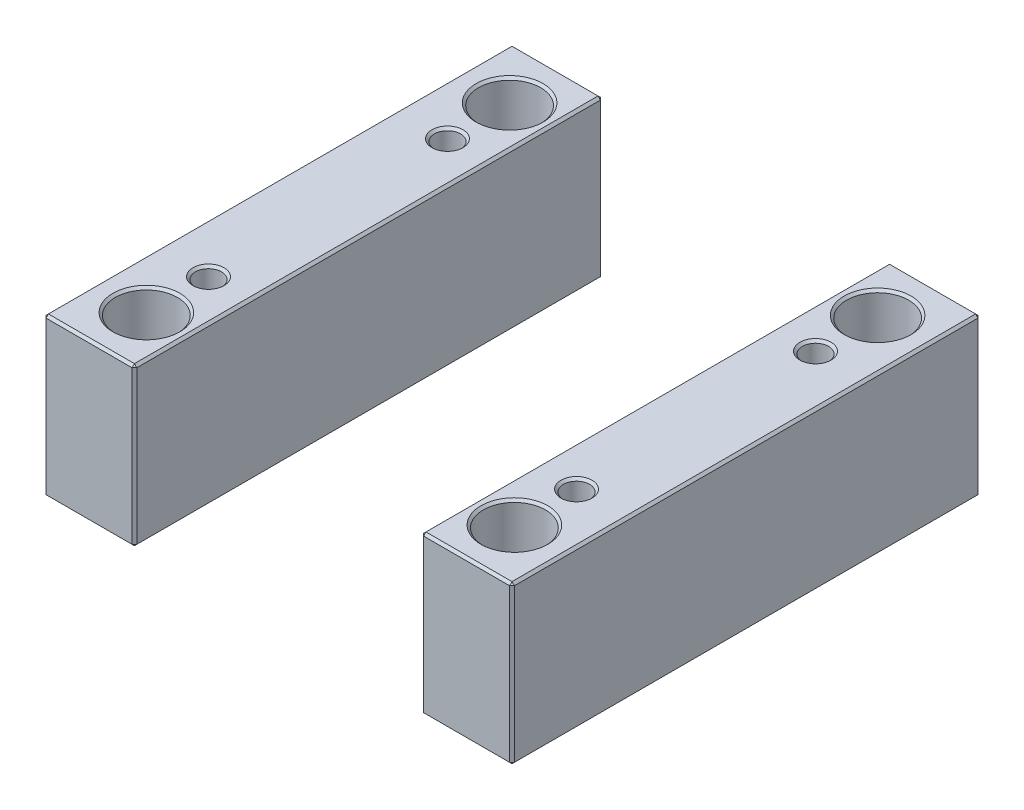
ISO-10303-21;
HEADER;
FILE_DESCRIPTION(('STEP AP214'),'2;1');
FILE_NAME('part.step','',(''),(''),'','','');
FILE_SCHEMA(('AUTOMOTIVE_DESIGN { 1 0 10303 214 1 1 1 1 }'));
ENDSEC;
DATA;
#1=APPLICATION_CONTEXT('core data for automotive mechanical design processes');
#2=APPLICATION_PROTOCOL_DEFINITION('international standard','automotive_design',2000,#1);
#3=PRODUCT_CONTEXT('',#1,'mechanical');
#4=PRODUCT('Part','Part','',(#3));
#5=PRODUCT_RELATED_PRODUCT_CATEGORY('part','',(#4));
#6=PRODUCT_DEFINITION_FORMATION('','',#4);
#7=PRODUCT_DEFINITION_CONTEXT('part definition',#1,'design');
#8=PRODUCT_DEFINITION('design','',#6,#7);
#9=PRODUCT_DEFINITION_SHAPE('','',#8);
#10=(LENGTH_UNIT() NAMED_UNIT(*) SI_UNIT(.MILLI.,.METRE.));
#11=(NAMED_UNIT(*) PLANE_ANGLE_UNIT() SI_UNIT($,.RADIAN.));
#12=(NAMED_UNIT(*) SI_UNIT($,.STERADIAN.) SOLID_ANGLE_UNIT());
#13=UNCERTAINTY_MEASURE_WITH_UNIT(LENGTH_MEASURE(1.E-05),#10,'distance_accuracy_value','');
#14=(GEOMETRIC_REPRESENTATION_CONTEXT(3) GLOBAL_UNCERTAINTY_ASSIGNED_CONTEXT((#13)) GLOBAL_UNIT_ASSIGNED_CONTEXT((#10,
#11,#12)) REPRESENTATION_CONTEXT('',''));
#15=CARTESIAN_POINT('',(0.,0.,0.));
#16=DIRECTION('',(0.,0.,1.));
#17=DIRECTION('',(1.,0.,0.));
#18=AXIS2_PLACEMENT_3D('',#15,#16,#17);
#19=CARTESIAN_POINT('',(-98.,66.,-98.));
#20=DIRECTION('',(0.,0.,1.));
#21=DIRECTION('',(1.,0.,0.));
#22=AXIS2_PLACEMENT_3D('',#19,#20,#21);
#23=PLANE('',#22);
#24=DIRECTION('',(-1.,0.,0.));
#25=VECTOR('',#24,1.);
#26=CARTESIAN_POINT('',(-98.,1.,-98.));
#27=LINE('',#26,#25);
#28=CARTESIAN_POINT('',(-61.,1.,-98.));
#29=VERTEX_POINT('',#28);
#30=CARTESIAN_POINT('',(-97.,1.,-98.));
#31=VERTEX_POINT('',#30);
#32=EDGE_CURVE('P0_E137',#29,#31,#27,.T.);
#33=ORIENTED_EDGE('',*,*,#32,.T.);
#34=DIRECTION('',(0.,1.,0.));
#35=VECTOR('',#34,1.);
#36=CARTESIAN_POINT('',(-97.,66.,-98.));
#37=LINE('',#36,#35);
#38=CARTESIAN_POINT('',(-97.,65.,-98.));
#39=VERTEX_POINT('',#38);
#40=EDGE_CURVE('P0_E265',#31,#39,#37,.T.);
#41=ORIENTED_EDGE('',*,*,#40,.T.);
#42=DIRECTION('',(1.,0.,0.));
#43=VECTOR('',#42,1.);
#44=CARTESIAN_POINT('',(-98.,65.,-98.));
#45=LINE('',#44,#43);
#46=CARTESIAN_POINT('',(-61.,65.,-98.));
#47=VERTEX_POINT('',#46);
#48=EDGE_CURVE('P0_E263',#39,#47,#45,.T.);
#49=ORIENTED_EDGE('',*,*,#48,.T.);
#50=DIRECTION('',(0.,-1.,0.));
#51=VECTOR('',#50,1.);
#52=CARTESIAN_POINT('',(-61.,66.,-98.));
#53=LINE('',#52,#51);
#54=EDGE_CURVE('P0_E260',#47,#29,#53,.T.);
#55=ORIENTED_EDGE('',*,*,#54,.T.);
#56=EDGE_LOOP('',(#33,#41,#49,#55));
#57=FACE_BOUND('',#56,.T.);
#58=ADVANCED_FACE('P0_F16',(#57),#23,.F.);
#59=CARTESIAN_POINT('',(-98.,66.,98.));
#60=DIRECTION('',(1.,0.,0.));
#61=DIRECTION('',(0.,0.,-1.));
#62=AXIS2_PLACEMENT_3D('',#59,#60,#61);
#63=PLANE('',#62);
#64=DIRECTION('',(0.,1.,0.));
#65=VECTOR('',#64,1.);
#66=CARTESIAN_POINT('',(-98.,66.,97.));
#67=LINE('',#66,#65);
#68=CARTESIAN_POINT('',(-98.,1.,97.));
#69=VERTEX_POINT('',#68);
#70=CARTESIAN_POINT('',(-98.,65.,97.));
#71=VERTEX_POINT('',#70);
#72=EDGE_CURVE('P0_E253',#69,#71,#67,.T.);
#73=ORIENTED_EDGE('',*,*,#72,.T.);
#74=DIRECTION('',(0.,0.,-1.));
#75=VECTOR('',#74,1.);
#76=CARTESIAN_POINT('',(-98.,65.,98.));
#77=LINE('',#76,#75);
#78=CARTESIAN_POINT('',(-98.,65.,-97.));
#79=VERTEX_POINT('',#78);
#80=EDGE_CURVE('P0_E258',#71,#79,#77,.T.);
#81=ORIENTED_EDGE('',*,*,#80,.T.);
#82=DIRECTION('',(0.,-1.,0.));
#83=VECTOR('',#82,1.);
#84=CARTESIAN_POINT('',(-98.,66.,-97.));
#85=LINE('',#84,#83);
#86=CARTESIAN_POINT('',(-98.,1.,-97.));
#87=VERTEX_POINT('',#86);
#88=EDGE_CURVE('P0_E255',#79,#87,#85,.T.);
#89=ORIENTED_EDGE('',*,*,#88,.T.);
#90=DIRECTION('',(0.,0.,1.));
#91=VECTOR('',#90,1.);
#92=CARTESIAN_POINT('',(-98.,1.,98.));
#93=LINE('',#92,#91);
#94=EDGE_CURVE('P0_E251',#87,#69,#93,.T.);
#95=ORIENTED_EDGE('',*,*,#94,.T.);
#96=EDGE_LOOP('',(#73,#81,#89,#95));
#97=FACE_BOUND('',#96,.T.);
#98=ADVANCED_FACE('P0_F333',(#97),#63,.F.);
#99=CARTESIAN_POINT('',(-98.,66.,98.));
#100=DIRECTION('',(0.,0.,-1.));
#101=DIRECTION('',(-1.,0.,0.));
#102=AXIS2_PLACEMENT_3D('',#99,#100,#101);
#103=PLANE('',#102);
#104=DIRECTION('',(-1.,0.,0.));
#105=VECTOR('',#104,1.);
#106=CARTESIAN_POINT('',(-98.,65.,98.));
#107=LINE('',#106,#105);
#108=CARTESIAN_POINT('',(-61.,65.,98.));
#109=VERTEX_POINT('',#108);
#110=CARTESIAN_POINT('',(-97.,65.,98.));
#111=VERTEX_POINT('',#110);
#112=EDGE_CURVE('P0_E272',#109,#111,#107,.T.);
#113=ORIENTED_EDGE('',*,*,#112,.T.);
#114=DIRECTION('',(0.,-1.,0.));
#115=VECTOR('',#114,1.);
#116=CARTESIAN_POINT('',(-97.,66.,98.));
#117=LINE('',#116,#115);
#118=CARTESIAN_POINT('',(-97.,1.,98.));
#119=VERTEX_POINT('',#118);
#120=EDGE_CURVE('P0_E274',#111,#119,#117,.T.);
#121=ORIENTED_EDGE('',*,*,#120,.T.);
#122=DIRECTION('',(1.,0.,0.));
#123=VECTOR('',#122,1.);
#124=CARTESIAN_POINT('',(-60.,1.,98.));
#125=LINE('',#124,#123);
#126=CARTESIAN_POINT('',(-61.,1.,98.));
#127=VERTEX_POINT('',#126);
#128=EDGE_CURVE('P0_E270',#119,#127,#125,.T.);
#129=ORIENTED_EDGE('',*,*,#128,.T.);
#130=DIRECTION('',(0.,1.,0.));
#131=VECTOR('',#130,1.);
#132=CARTESIAN_POINT('',(-61.,66.,98.));
#133=LINE('',#132,#131);
#134=EDGE_CURVE('P0_E268',#127,#109,#133,.T.);
#135=ORIENTED_EDGE('',*,*,#134,.T.);
#136=EDGE_LOOP('',(#113,#121,#129,#135));
#137=FACE_BOUND('',#136,.T.);
#138=ADVANCED_FACE('P0_F372',(#137),#103,.F.);
#139=CARTESIAN_POINT('',(-60.,66.,-98.));
#140=DIRECTION('',(-1.,0.,0.));
#141=DIRECTION('',(0.,0.,1.));
#142=AXIS2_PLACEMENT_3D('',#139,#140,#141);
#143=PLANE('',#142);
#144=DIRECTION('',(0.,0.,1.));
#145=VECTOR('',#144,1.);
#146=CARTESIAN_POINT('',(-60.,65.,-98.));
#147=LINE('',#146,#145);
#148=CARTESIAN_POINT('',(-60.,65.,-97.));
#149=VERTEX_POINT('',#148);
#150=CARTESIAN_POINT('',(-60.,65.,97.));
#151=VERTEX_POINT('',#150);
#152=EDGE_CURVE('P0_E31',#149,#151,#147,.T.);
#153=ORIENTED_EDGE('',*,*,#152,.T.);
#154=DIRECTION('',(0.,-1.,0.));
#155=VECTOR('',#154,1.);
#156=CARTESIAN_POINT('',(-60.,66.,97.));
#157=LINE('',#156,#155);
#158=CARTESIAN_POINT('',(-60.,1.,97.));
#159=VERTEX_POINT('',#158);
#160=EDGE_CURVE('P0_E190',#151,#159,#157,.T.);
#161=ORIENTED_EDGE('',*,*,#160,.T.);
#162=DIRECTION('',(0.,0.,-1.));
#163=VECTOR('',#162,1.);
#164=CARTESIAN_POINT('',(-60.,1.,-98.));
#165=LINE('',#164,#163);
#166=CARTESIAN_POINT('',(-60.,1.,-97.));
#167=VERTEX_POINT('',#166);
#168=EDGE_CURVE('P0_E286',#159,#167,#165,.T.);
#169=ORIENTED_EDGE('',*,*,#168,.T.);
#170=DIRECTION('',(0.,1.,0.));
#171=VECTOR('',#170,1.);
#172=CARTESIAN_POINT('',(-60.,66.,-97.));
#173=LINE('',#172,#171);
#174=EDGE_CURVE('P0_E36',#167,#149,#173,.T.);
#175=ORIENTED_EDGE('',*,*,#174,.T.);
#176=EDGE_LOOP('',(#153,#161,#169,#175));
#177=FACE_BOUND('',#176,.T.);
#178=ADVANCED_FACE('P0_F649',(#177),#143,.F.);
#179=CARTESIAN_POINT('',(0.,66.,0.));
#180=DIRECTION('',(0.,-1.,0.));
#181=DIRECTION('',(0.,0.,-1.));
#182=AXIS2_PLACEMENT_3D('',#179,#180,#181);
#183=PLANE('',#182);
#184=CARTESIAN_POINT('',(-77.,66.,-76.));
#185=DIRECTION('',(0.,-1.,0.));
#186=DIRECTION('',(0.,0.,-1.));
#187=AXIS2_PLACEMENT_3D('',#184,#185,#186);
#188=CIRCLE('',#187,14.);
#189=CARTESIAN_POINT('',(-77.,66.,-90.));
#190=VERTEX_POINT('',#189);
#191=EDGE_CURVE('P0_E214',#190,#190,#188,.T.);
#192=ORIENTED_EDGE('',*,*,#191,.T.);
#193=EDGE_LOOP('',(#192));
#194=FACE_BOUND('',#193,.T.);
#195=CARTESIAN_POINT('',(-77.,66.,76.));
#196=DIRECTION('',(0.,-1.,0.));
#197=DIRECTION('',(0.,0.,-1.));
#198=AXIS2_PLACEMENT_3D('',#195,#196,#197);
#199=CIRCLE('',#198,14.);
#200=CARTESIAN_POINT('',(-77.,66.,62.));
#201=VERTEX_POINT('',#200);
#202=EDGE_CURVE('P0_E211',#201,#201,#199,.T.);
#203=ORIENTED_EDGE('',*,*,#202,.T.);
#204=EDGE_LOOP('',(#203));
#205=FACE_BOUND('',#204,.T.);
#206=CARTESIAN_POINT('',(-77.,66.,50.));
#207=DIRECTION('',(0.,-1.,0.));
#208=DIRECTION('',(0.,0.,-1.));
#209=AXIS2_PLACEMENT_3D('',#206,#207,#208);
#210=CIRCLE('',#209,6.5);
#211=CARTESIAN_POINT('',(-77.,66.,43.5));
#212=VERTEX_POINT('',#211);
#213=EDGE_CURVE('P0_E193',#212,#212,#210,.T.);
#214=ORIENTED_EDGE('',*,*,#213,.T.);
#215=EDGE_LOOP('',(#214));
#216=FACE_BOUND('',#215,.T.);
#217=CARTESIAN_POINT('',(-77.,66.,-50.));
#218=DIRECTION('',(0.,-1.,0.));
#219=DIRECTION('',(0.,0.,-1.));
#220=AXIS2_PLACEMENT_3D('',#217,#218,#219);
#221=CIRCLE('',#220,6.5);
#222=CARTESIAN_POINT('',(-77.,66.,-56.5));
#223=VERTEX_POINT('',#222);
#224=EDGE_CURVE('P0_E189',#223,#223,#221,.T.);
#225=ORIENTED_EDGE('',*,*,#224,.T.);
#226=EDGE_LOOP('',(#225));
#227=FACE_BOUND('',#226,.T.);
#228=DIRECTION('',(0.,0.,1.));
#229=VECTOR('',#228,1.);
#230=CARTESIAN_POINT('',(-97.,66.,0.));
#231=LINE('',#230,#229);
#232=CARTESIAN_POINT('',(-97.,66.,-97.));
#233=VERTEX_POINT('',#232);
#234=CARTESIAN_POINT('',(-97.,66.,97.));
#235=VERTEX_POINT('',#234);
#236=EDGE_CURVE('P0_E281',#233,#235,#231,.T.);
#237=ORIENTED_EDGE('',*,*,#236,.T.);
#238=DIRECTION('',(1.,0.,0.));
#239=VECTOR('',#238,1.);
#240=CARTESIAN_POINT('',(0.,66.,97.));
#241=LINE('',#240,#239);
#242=CARTESIAN_POINT('',(-61.,66.,97.));
#243=VERTEX_POINT('',#242);
#244=EDGE_CURVE('P0_E283',#235,#243,#241,.T.);
#245=ORIENTED_EDGE('',*,*,#244,.T.);
#246=DIRECTION('',(0.,0.,-1.));
#247=VECTOR('',#246,1.);
#248=CARTESIAN_POINT('',(-61.,66.,0.));
#249=LINE('',#248,#247);
#250=CARTESIAN_POINT('',(-61.,66.,-97.));
#251=VERTEX_POINT('',#250);
#252=EDGE_CURVE('P0_E277',#243,#251,#249,.T.);
#253=ORIENTED_EDGE('',*,*,#252,.T.);
#254=DIRECTION('',(-1.,0.,0.));
#255=VECTOR('',#254,1.);
#256=CARTESIAN_POINT('',(0.,66.,-97.));
#257=LINE('',#256,#255);
#258=EDGE_CURVE('P0_E279',#251,#233,#257,.T.);
#259=ORIENTED_EDGE('',*,*,#258,.T.);
#260=EDGE_LOOP('',(#237,#245,#253,#259));
#261=FACE_BOUND('',#260,.T.);
#262=ADVANCED_FACE('P0_F229',(#194,#205,#216,#227,#261),#183,.F.);
#263=CARTESIAN_POINT('',(0.,0.,0.));
#264=DIRECTION('',(0.,-1.,0.));
#265=DIRECTION('',(0.,0.,-1.));
#266=AXIS2_PLACEMENT_3D('',#263,#264,#265);
#267=PLANE('',#266);
#268=CARTESIAN_POINT('',(-77.,0.,-76.));
#269=DIRECTION('',(0.,-1.,0.));
#270=DIRECTION('',(0.,0.,-1.));
#271=AXIS2_PLACEMENT_3D('',#268,#269,#270);
#272=CIRCLE('',#271,14.);
#273=CARTESIAN_POINT('',(-77.,0.,-90.));
#274=VERTEX_POINT('',#273);
#275=EDGE_CURVE('P0_E202',#274,#274,#272,.F.);
#276=ORIENTED_EDGE('',*,*,#275,.T.);
#277=EDGE_LOOP('',(#276));
#278=FACE_BOUND('',#277,.T.);
#279=CARTESIAN_POINT('',(-77.,0.,76.));
#280=DIRECTION('',(0.,-1.,0.));
#281=DIRECTION('',(0.,0.,-1.));
#282=AXIS2_PLACEMENT_3D('',#279,#280,#281);
#283=CIRCLE('',#282,14.);
#284=CARTESIAN_POINT('',(-77.,0.,62.));
#285=VERTEX_POINT('',#284);
#286=EDGE_CURVE('P0_E199',#285,#285,#283,.F.);
#287=ORIENTED_EDGE('',*,*,#286,.T.);
#288=EDGE_LOOP('',(#287));
#289=FACE_BOUND('',#288,.T.);
#290=CARTESIAN_POINT('',(-77.,0.,-50.));
#291=DIRECTION('',(0.,-1.,0.));
#292=DIRECTION('',(0.,0.,-1.));
#293=AXIS2_PLACEMENT_3D('',#290,#291,#292);
#294=CIRCLE('',#293,6.5);
#295=CARTESIAN_POINT('',(-77.,0.,-56.5));
#296=VERTEX_POINT('',#295);
#297=EDGE_CURVE('P0_E235',#296,#296,#294,.F.);
#298=ORIENTED_EDGE('',*,*,#297,.T.);
#299=EDGE_LOOP('',(#298));
#300=FACE_BOUND('',#299,.T.);
#301=CARTESIAN_POINT('',(-77.,0.,50.));
#302=DIRECTION('',(0.,-1.,0.));
#303=DIRECTION('',(0.,0.,-1.));
#304=AXIS2_PLACEMENT_3D('',#301,#302,#303);
#305=CIRCLE('',#304,6.5);
#306=CARTESIAN_POINT('',(-77.,0.,43.5));
#307=VERTEX_POINT('',#306);
#308=EDGE_CURVE('P0_E238',#307,#307,#305,.F.);
#309=ORIENTED_EDGE('',*,*,#308,.T.);
#310=EDGE_LOOP('',(#309));
#311=FACE_BOUND('',#310,.T.);
#312=DIRECTION('',(-1.,0.,0.));
#313=VECTOR('',#312,1.);
#314=CARTESIAN_POINT('',(-98.,0.,97.));
#315=LINE('',#314,#313);
#316=CARTESIAN_POINT('',(-61.,0.,97.));
#317=VERTEX_POINT('',#316);
#318=CARTESIAN_POINT('',(-97.,0.,97.));
#319=VERTEX_POINT('',#318);
#320=EDGE_CURVE('P0_E114',#317,#319,#315,.T.);
#321=ORIENTED_EDGE('',*,*,#320,.T.);
#322=DIRECTION('',(0.,0.,-1.));
#323=VECTOR('',#322,1.);
#324=CARTESIAN_POINT('',(-97.,0.,-98.));
#325=LINE('',#324,#323);
#326=CARTESIAN_POINT('',(-97.,0.,-97.));
#327=VERTEX_POINT('',#326);
#328=EDGE_CURVE('P0_E110',#319,#327,#325,.T.);
#329=ORIENTED_EDGE('',*,*,#328,.T.);
#330=DIRECTION('',(1.,0.,0.));
#331=VECTOR('',#330,1.);
#332=CARTESIAN_POINT('',(-60.,0.,-97.));
#333=LINE('',#332,#331);
#334=CARTESIAN_POINT('',(-61.,0.,-97.));
#335=VERTEX_POINT('',#334);
#336=EDGE_CURVE('P0_E104',#327,#335,#333,.T.);
#337=ORIENTED_EDGE('',*,*,#336,.T.);
#338=DIRECTION('',(0.,0.,1.));
#339=VECTOR('',#338,1.);
#340=CARTESIAN_POINT('',(-61.,0.,98.));
#341=LINE('',#340,#339);
#342=EDGE_CURVE('P0_E107',#335,#317,#341,.T.);
#343=ORIENTED_EDGE('',*,*,#342,.T.);
#344=EDGE_LOOP('',(#321,#329,#337,#343));
#345=FACE_BOUND('',#344,.T.);
#346=ADVANCED_FACE('P0_F106',(#278,#289,#300,#311,#345),#267,.T.);
#347=CARTESIAN_POINT('',(-77.,0.,-50.));
#348=DIRECTION('',(0.,1.,0.));
#349=DIRECTION('',(0.,0.,1.));
#350=AXIS2_PLACEMENT_3D('',#347,#348,#349);
#351=CYLINDRICAL_SURFACE('',#350,5.5);
#352=CARTESIAN_POINT('',(-77.,65.,-50.));
#353=DIRECTION('',(0.,-1.,0.));
#354=DIRECTION('',(0.,0.,-1.));
#355=AXIS2_PLACEMENT_3D('',#352,#353,#354);
#356=CIRCLE('',#355,5.5);
#357=CARTESIAN_POINT('',(-77.,65.,-55.5));
#358=VERTEX_POINT('',#357);
#359=EDGE_CURVE('P0_E196',#358,#358,#356,.F.);
#360=ORIENTED_EDGE('',*,*,#359,.T.);
#361=EDGE_LOOP('',(#360));
#362=FACE_BOUND('',#361,.T.);
#363=CARTESIAN_POINT('',(-77.,1.00000000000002,-50.));
#364=DIRECTION('',(0.,-1.,0.));
#365=DIRECTION('',(0.,0.,-1.));
#366=AXIS2_PLACEMENT_3D('',#363,#364,#365);
#367=CIRCLE('',#366,5.5);
#368=CARTESIAN_POINT('',(-77.,1.00000000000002,-55.5));
#369=VERTEX_POINT('',#368);
#370=EDGE_CURVE('P0_E241',#369,#369,#367,.T.);
#371=ORIENTED_EDGE('',*,*,#370,.T.);
#372=EDGE_LOOP('',(#371));
#373=FACE_BOUND('',#372,.T.);
#374=ADVANCED_FACE('P0_F228',(#362,#373),#351,.F.);
#375=CARTESIAN_POINT('',(-77.,0.,50.));
#376=DIRECTION('',(0.,1.,0.));
#377=DIRECTION('',(0.,0.,1.));
#378=AXIS2_PLACEMENT_3D('',#375,#376,#377);
#379=CYLINDRICAL_SURFACE('',#378,5.5);
#380=CARTESIAN_POINT('',(-77.,65.,50.));
#381=DIRECTION('',(0.,-1.,0.));
#382=DIRECTION('',(0.,0.,-1.));
#383=AXIS2_PLACEMENT_3D('',#380,#381,#382);
#384=CIRCLE('',#383,5.5);
#385=CARTESIAN_POINT('',(-77.,65.,44.5));
#386=VERTEX_POINT('',#385);
#387=EDGE_CURVE('P0_E186',#386,#386,#384,.F.);
#388=ORIENTED_EDGE('',*,*,#387,.T.);
#389=EDGE_LOOP('',(#388));
#390=FACE_BOUND('',#389,.T.);
#391=CARTESIAN_POINT('',(-77.,1.00000000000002,50.));
#392=DIRECTION('',(0.,-1.,0.));
#393=DIRECTION('',(0.,0.,-1.));
#394=AXIS2_PLACEMENT_3D('',#391,#392,#393);
#395=CIRCLE('',#394,5.5);
#396=CARTESIAN_POINT('',(-77.,1.00000000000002,44.5));
#397=VERTEX_POINT('',#396);
#398=EDGE_CURVE('P0_E248',#397,#397,#395,.T.);
#399=ORIENTED_EDGE('',*,*,#398,.T.);
#400=EDGE_LOOP('',(#399));
#401=FACE_BOUND('',#400,.T.);
#402=ADVANCED_FACE('P0_F380',(#390,#401),#379,.F.);
#403=CARTESIAN_POINT('',(-77.,0.,-50.));
#404=DIRECTION('',(0.,-1.,0.));
#405=DIRECTION('',(0.,0.,-1.));
#406=AXIS2_PLACEMENT_3D('',#403,#404,#405);
#407=CONICAL_SURFACE('',#406,6.5,0.785398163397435);
#408=ORIENTED_EDGE('',*,*,#370,.F.);
#409=EDGE_LOOP('',(#408));
#410=FACE_BOUND('',#409,.T.);
#411=ORIENTED_EDGE('',*,*,#297,.F.);
#412=EDGE_LOOP('',(#411));
#413=FACE_BOUND('',#412,.T.);
#414=ADVANCED_FACE('P0_F376',(#410,#413),#407,.F.);
#415=CARTESIAN_POINT('',(-77.,0.,50.));
#416=DIRECTION('',(0.,-1.,0.));
#417=DIRECTION('',(0.,0.,-1.));
#418=AXIS2_PLACEMENT_3D('',#415,#416,#417);
#419=CONICAL_SURFACE('',#418,6.5,0.785398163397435);
#420=ORIENTED_EDGE('',*,*,#398,.F.);
#421=EDGE_LOOP('',(#420));
#422=FACE_BOUND('',#421,.T.);
#423=ORIENTED_EDGE('',*,*,#308,.F.);
#424=EDGE_LOOP('',(#423));
#425=FACE_BOUND('',#424,.T.);
#426=ADVANCED_FACE('P0_F379',(#422,#425),#419,.F.);
#427=CARTESIAN_POINT('',(-60.,66.,97.));
#428=DIRECTION('',(-0.707106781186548,0.,-0.707106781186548));
#429=DIRECTION('',(0.,-1.,0.));
#430=AXIS2_PLACEMENT_3D('',#427,#428,#429);
#431=PLANE('',#430);
#432=DIRECTION('',(-0.707106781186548,0.,0.707106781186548));
#433=VECTOR('',#432,1.);
#434=CARTESIAN_POINT('',(-60.5,65.,97.5));
#435=LINE('',#434,#433);
#436=EDGE_CURVE('P0_E125',#109,#151,#435,.F.);
#437=ORIENTED_EDGE('',*,*,#436,.F.);
#438=ORIENTED_EDGE('',*,*,#134,.F.);
#439=DIRECTION('',(0.707106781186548,0.,-0.707106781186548));
#440=VECTOR('',#439,1.);
#441=CARTESIAN_POINT('',(-61.,1.,98.));
#442=LINE('',#441,#440);
#443=EDGE_CURVE('P0_E181',#159,#127,#442,.F.);
#444=ORIENTED_EDGE('',*,*,#443,.F.);
#445=ORIENTED_EDGE('',*,*,#160,.F.);
#446=EDGE_LOOP('',(#437,#438,#444,#445));
#447=FACE_BOUND('',#446,.T.);
#448=ADVANCED_FACE('P0_F384',(#447),#431,.F.);
#449=CARTESIAN_POINT('',(-61.,66.,97.));
#450=DIRECTION('',(0.577350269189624,0.577350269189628,0.577350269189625));
#451=DIRECTION('',(0.,-0.707106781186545,0.70710678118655));
#452=AXIS2_PLACEMENT_3D('',#449,#450,#451);
#453=PLANE('',#452);
#454=DIRECTION('',(0.,0.707106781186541,-0.707106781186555));
#455=VECTOR('',#454,1.);
#456=CARTESIAN_POINT('',(-61.,66.,97.));
#457=LINE('',#456,#455);
#458=EDGE_CURVE('P0_E175',#109,#243,#457,.T.);
#459=ORIENTED_EDGE('',*,*,#458,.F.);
#460=ORIENTED_EDGE('',*,*,#436,.T.);
#461=DIRECTION('',(0.707106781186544,-0.707106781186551,0.));
#462=VECTOR('',#461,1.);
#463=CARTESIAN_POINT('',(-61.,66.,97.));
#464=LINE('',#463,#462);
#465=EDGE_CURVE('P0_E178',#243,#151,#464,.T.);
#466=ORIENTED_EDGE('',*,*,#465,.F.);
#467=EDGE_LOOP('',(#459,#460,#466));
#468=FACE_BOUND('',#467,.T.);
#469=ADVANCED_FACE('P0_F588',(#468),#453,.T.);
#470=CARTESIAN_POINT('',(-61.,1.,98.));
#471=DIRECTION('',(0.577350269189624,-0.577350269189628,0.577350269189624));
#472=DIRECTION('',(0.,-0.707106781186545,-0.70710678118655));
#473=AXIS2_PLACEMENT_3D('',#470,#471,#472);
#474=PLANE('',#473);
#475=DIRECTION('',(0.707106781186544,0.707106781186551,0.));
#476=VECTOR('',#475,1.);
#477=CARTESIAN_POINT('',(-60.5,0.500000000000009,97.));
#478=LINE('',#477,#476);
#479=EDGE_CURVE('P0_E123',#159,#317,#478,.F.);
#480=ORIENTED_EDGE('',*,*,#479,.F.);
#481=ORIENTED_EDGE('',*,*,#443,.T.);
#482=DIRECTION('',(0.,-0.707106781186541,-0.707106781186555));
#483=VECTOR('',#482,1.);
#484=CARTESIAN_POINT('',(-61.,1.,98.));
#485=LINE('',#484,#483);
#486=EDGE_CURVE('P0_E172',#317,#127,#485,.F.);
#487=ORIENTED_EDGE('',*,*,#486,.F.);
#488=EDGE_LOOP('',(#480,#481,#487));
#489=FACE_BOUND('',#488,.T.);
#490=ADVANCED_FACE('P0_F597',(#489),#474,.T.);
#491=CARTESIAN_POINT('',(-61.,66.,0.));
#492=DIRECTION('',(-0.707106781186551,-0.707106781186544,0.));
#493=DIRECTION('',(0.,0.,-1.));
#494=AXIS2_PLACEMENT_3D('',#491,#492,#493);
#495=PLANE('',#494);
#496=ORIENTED_EDGE('',*,*,#465,.T.);
#497=ORIENTED_EDGE('',*,*,#152,.F.);
#498=DIRECTION('',(-0.707106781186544,0.707106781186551,0.));
#499=VECTOR('',#498,1.);
#500=CARTESIAN_POINT('',(-60.5,65.5,-97.));
#501=LINE('',#500,#499);
#502=EDGE_CURVE('P0_E165',#251,#149,#501,.F.);
#503=ORIENTED_EDGE('',*,*,#502,.F.);
#504=ORIENTED_EDGE('',*,*,#252,.F.);
#505=EDGE_LOOP('',(#496,#497,#503,#504));
#506=FACE_BOUND('',#505,.T.);
#507=ADVANCED_FACE('P0_F349',(#506),#495,.F.);
#508=CARTESIAN_POINT('',(0.,66.,97.));
#509=DIRECTION('',(0.,-0.707106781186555,-0.707106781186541));
#510=DIRECTION('',(1.,0.,0.));
#511=AXIS2_PLACEMENT_3D('',#508,#509,#510);
#512=PLANE('',#511);
#513=ORIENTED_EDGE('',*,*,#458,.T.);
#514=ORIENTED_EDGE('',*,*,#244,.F.);
#515=DIRECTION('',(0.,-0.70710678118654,0.707106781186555));
#516=VECTOR('',#515,1.);
#517=CARTESIAN_POINT('',(-97.,65.5,97.5));
#518=LINE('',#517,#516);
#519=EDGE_CURVE('P0_E162',#111,#235,#518,.F.);
#520=ORIENTED_EDGE('',*,*,#519,.F.);
#521=ORIENTED_EDGE('',*,*,#112,.F.);
#522=EDGE_LOOP('',(#513,#514,#520,#521));
#523=FACE_BOUND('',#522,.T.);
#524=ADVANCED_FACE('P0_F344',(#523),#512,.F.);
#525=CARTESIAN_POINT('',(-97.,66.,98.));
#526=DIRECTION('',(0.707106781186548,0.,-0.707106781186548));
#527=DIRECTION('',(0.,-1.,0.));
#528=AXIS2_PLACEMENT_3D('',#525,#526,#527);
#529=PLANE('',#528);
#530=DIRECTION('',(0.707106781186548,0.,0.707106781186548));
#531=VECTOR('',#530,1.);
#532=CARTESIAN_POINT('',(-97.,1.,98.));
#533=LINE('',#532,#531);
#534=EDGE_CURVE('P0_E156',#119,#69,#533,.F.);
#535=ORIENTED_EDGE('',*,*,#534,.F.);
#536=ORIENTED_EDGE('',*,*,#120,.F.);
#537=DIRECTION('',(-0.707106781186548,0.,-0.707106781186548));
#538=VECTOR('',#537,1.);
#539=CARTESIAN_POINT('',(-98.,65.,97.));
#540=LINE('',#539,#538);
#541=EDGE_CURVE('P0_E159',#71,#111,#540,.F.);
#542=ORIENTED_EDGE('',*,*,#541,.F.);
#543=ORIENTED_EDGE('',*,*,#72,.F.);
#544=EDGE_LOOP('',(#535,#536,#542,#543));
#545=FACE_BOUND('',#544,.T.);
#546=ADVANCED_FACE('P0_F338',(#545),#529,.F.);
#547=CARTESIAN_POINT('',(-98.,1.,98.));
#548=DIRECTION('',(0.,-0.707106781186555,0.707106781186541));
#549=DIRECTION('',(-1.,0.,0.));
#550=AXIS2_PLACEMENT_3D('',#547,#548,#549);
#551=PLANE('',#550);
#552=ORIENTED_EDGE('',*,*,#486,.T.);
#553=ORIENTED_EDGE('',*,*,#128,.F.);
#554=DIRECTION('',(0.,0.70710678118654,0.707106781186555));
#555=VECTOR('',#554,1.);
#556=CARTESIAN_POINT('',(-97.,1.,98.));
#557=LINE('',#556,#555);
#558=EDGE_CURVE('P0_E134',#319,#119,#557,.T.);
#559=ORIENTED_EDGE('',*,*,#558,.F.);
#560=ORIENTED_EDGE('',*,*,#320,.F.);
#561=EDGE_LOOP('',(#552,#553,#559,#560));
#562=FACE_BOUND('',#561,.T.);
#563=ADVANCED_FACE('P0_F364',(#562),#551,.T.);
#564=CARTESIAN_POINT('',(-60.,1.,-98.));
#565=DIRECTION('',(0.707106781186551,-0.707106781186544,0.));
#566=DIRECTION('',(0.,0.,1.));
#567=AXIS2_PLACEMENT_3D('',#564,#565,#566);
#568=PLANE('',#567);
#569=ORIENTED_EDGE('',*,*,#479,.T.);
#570=ORIENTED_EDGE('',*,*,#342,.F.);
#571=DIRECTION('',(-0.707106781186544,-0.707106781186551,0.));
#572=VECTOR('',#571,1.);
#573=CARTESIAN_POINT('',(-61.,0.,-97.));
#574=LINE('',#573,#572);
#575=EDGE_CURVE('P0_E120',#167,#335,#574,.T.);
#576=ORIENTED_EDGE('',*,*,#575,.F.);
#577=ORIENTED_EDGE('',*,*,#168,.F.);
#578=EDGE_LOOP('',(#569,#570,#576,#577));
#579=FACE_BOUND('',#578,.T.);
#580=ADVANCED_FACE('P0_F119',(#579),#568,.T.);
#581=CARTESIAN_POINT('',(-61.,66.,-98.));
#582=DIRECTION('',(-0.707106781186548,0.,0.707106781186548));
#583=DIRECTION('',(0.,-1.,0.));
#584=AXIS2_PLACEMENT_3D('',#581,#582,#583);
#585=PLANE('',#584);
#586=DIRECTION('',(0.707106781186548,0.,0.707106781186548));
#587=VECTOR('',#586,1.);
#588=CARTESIAN_POINT('',(-61.,65.,-98.));
#589=LINE('',#588,#587);
#590=EDGE_CURVE('P0_E168',#149,#47,#589,.F.);
#591=ORIENTED_EDGE('',*,*,#590,.F.);
#592=ORIENTED_EDGE('',*,*,#174,.F.);
#593=DIRECTION('',(-0.707106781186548,0.,-0.707106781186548));
#594=VECTOR('',#593,1.);
#595=CARTESIAN_POINT('',(-60.5,1.,-97.5));
#596=LINE('',#595,#594);
#597=EDGE_CURVE('P0_E133',#29,#167,#596,.F.);
#598=ORIENTED_EDGE('',*,*,#597,.F.);
#599=ORIENTED_EDGE('',*,*,#54,.F.);
#600=EDGE_LOOP('',(#591,#592,#598,#599));
#601=FACE_BOUND('',#600,.T.);
#602=ADVANCED_FACE('P0_F354',(#601),#585,.F.);
#603=CARTESIAN_POINT('',(-61.,65.,-98.));
#604=DIRECTION('',(0.57735026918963,0.577350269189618,-0.57735026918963));
#605=DIRECTION('',(-0.707106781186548,0.,-0.707106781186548));
#606=AXIS2_PLACEMENT_3D('',#603,#604,#605);
#607=PLANE('',#606);
#608=ORIENTED_EDGE('',*,*,#502,.T.);
#609=ORIENTED_EDGE('',*,*,#590,.T.);
#610=DIRECTION('',(0.,-0.707106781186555,-0.707106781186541));
#611=VECTOR('',#610,1.);
#612=CARTESIAN_POINT('',(-61.,65.,-98.));
#613=LINE('',#612,#611);
#614=EDGE_CURVE('P0_E151',#251,#47,#613,.T.);
#615=ORIENTED_EDGE('',*,*,#614,.F.);
#616=EDGE_LOOP('',(#608,#609,#615));
#617=FACE_BOUND('',#616,.T.);
#618=ADVANCED_FACE('P0_F352',(#617),#607,.T.);
#619=CARTESIAN_POINT('',(-98.,65.,97.));
#620=DIRECTION('',(-0.577350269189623,0.577350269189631,0.577350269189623));
#621=DIRECTION('',(0.,-0.707106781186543,0.707106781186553));
#622=AXIS2_PLACEMENT_3D('',#619,#620,#621);
#623=PLANE('',#622);
#624=ORIENTED_EDGE('',*,*,#541,.T.);
#625=ORIENTED_EDGE('',*,*,#519,.T.);
#626=DIRECTION('',(0.707106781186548,0.707106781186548,0.));
#627=VECTOR('',#626,1.);
#628=CARTESIAN_POINT('',(-98.,65.,97.));
#629=LINE('',#628,#627);
#630=EDGE_CURVE('P0_E142',#71,#235,#629,.T.);
#631=ORIENTED_EDGE('',*,*,#630,.F.);
#632=EDGE_LOOP('',(#624,#625,#631));
#633=FACE_BOUND('',#632,.T.);
#634=ADVANCED_FACE('P0_F341',(#633),#623,.T.);
#635=CARTESIAN_POINT('',(-97.,1.,98.));
#636=DIRECTION('',(-0.577350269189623,-0.577350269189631,0.577350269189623));
#637=DIRECTION('',(0.,-0.707106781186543,-0.707106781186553));
#638=AXIS2_PLACEMENT_3D('',#635,#636,#637);
#639=PLANE('',#638);
#640=ORIENTED_EDGE('',*,*,#558,.T.);
#641=ORIENTED_EDGE('',*,*,#534,.T.);
#642=DIRECTION('',(0.707106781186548,-0.707106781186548,0.));
#643=VECTOR('',#642,1.);
#644=CARTESIAN_POINT('',(-97.5,0.500000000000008,97.));
#645=LINE('',#644,#643);
#646=EDGE_CURVE('P0_E138',#319,#69,#645,.F.);
#647=ORIENTED_EDGE('',*,*,#646,.F.);
#648=EDGE_LOOP('',(#640,#641,#647));
#649=FACE_BOUND('',#648,.T.);
#650=ADVANCED_FACE('P0_F403',(#649),#639,.T.);
#651=CARTESIAN_POINT('',(-61.,0.,-97.));
#652=DIRECTION('',(0.57735026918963,-0.577350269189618,-0.57735026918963));
#653=DIRECTION('',(-0.707106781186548,0.,-0.707106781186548));
#654=AXIS2_PLACEMENT_3D('',#651,#652,#653);
#655=PLANE('',#654);
#656=ORIENTED_EDGE('',*,*,#597,.T.);
#657=ORIENTED_EDGE('',*,*,#575,.T.);
#658=DIRECTION('',(0.,0.707106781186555,-0.707106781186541));
#659=VECTOR('',#658,1.);
#660=CARTESIAN_POINT('',(-61.,0.,-97.));
#661=LINE('',#660,#659);
#662=EDGE_CURVE('P0_E130',#29,#335,#661,.F.);
#663=ORIENTED_EDGE('',*,*,#662,.F.);
#664=EDGE_LOOP('',(#656,#657,#663));
#665=FACE_BOUND('',#664,.T.);
#666=ADVANCED_FACE('P0_F129',(#665),#655,.T.);
#667=CARTESIAN_POINT('',(0.,66.,-97.));
#668=DIRECTION('',(0.,-0.707106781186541,0.707106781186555));
#669=DIRECTION('',(-1.,0.,0.));
#670=AXIS2_PLACEMENT_3D('',#667,#668,#669);
#671=PLANE('',#670);
#672=ORIENTED_EDGE('',*,*,#614,.T.);
#673=ORIENTED_EDGE('',*,*,#48,.F.);
#674=DIRECTION('',(0.,0.707106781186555,0.707106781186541));
#675=VECTOR('',#674,1.);
#676=CARTESIAN_POINT('',(-97.,65.,-98.));
#677=LINE('',#676,#675);
#678=EDGE_CURVE('P0_E139',#233,#39,#677,.F.);
#679=ORIENTED_EDGE('',*,*,#678,.F.);
#680=ORIENTED_EDGE('',*,*,#258,.F.);
#681=EDGE_LOOP('',(#672,#673,#679,#680));
#682=FACE_BOUND('',#681,.T.);
#683=ADVANCED_FACE('P0_F316',(#682),#671,.F.);
#684=CARTESIAN_POINT('',(-97.,66.,0.));
#685=DIRECTION('',(0.707106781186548,-0.707106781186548,0.));
#686=DIRECTION('',(0.,0.,1.));
#687=AXIS2_PLACEMENT_3D('',#684,#685,#686);
#688=PLANE('',#687);
#689=ORIENTED_EDGE('',*,*,#630,.T.);
#690=ORIENTED_EDGE('',*,*,#236,.F.);
#691=DIRECTION('',(-0.707106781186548,-0.707106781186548,0.));
#692=VECTOR('',#691,1.);
#693=CARTESIAN_POINT('',(-97.5,65.5,-97.));
#694=LINE('',#693,#692);
#695=EDGE_CURVE('P0_E145',#79,#233,#694,.F.);
#696=ORIENTED_EDGE('',*,*,#695,.F.);
#697=ORIENTED_EDGE('',*,*,#80,.F.);
#698=EDGE_LOOP('',(#689,#690,#696,#697));
#699=FACE_BOUND('',#698,.T.);
#700=ADVANCED_FACE('P0_F310',(#699),#688,.F.);
#701=CARTESIAN_POINT('',(-98.,1.,98.));
#702=DIRECTION('',(-0.707106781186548,-0.707106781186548,0.));
#703=DIRECTION('',(0.,0.,-1.));
#704=AXIS2_PLACEMENT_3D('',#701,#702,#703);
#705=PLANE('',#704);
#706=ORIENTED_EDGE('',*,*,#646,.T.);
#707=ORIENTED_EDGE('',*,*,#94,.F.);
#708=DIRECTION('',(-0.707106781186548,0.707106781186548,0.));
#709=VECTOR('',#708,1.);
#710=CARTESIAN_POINT('',(-98.,1.,-97.));
#711=LINE('',#710,#709);
#712=EDGE_CURVE('P0_E297',#327,#87,#711,.T.);
#713=ORIENTED_EDGE('',*,*,#712,.F.);
#714=ORIENTED_EDGE('',*,*,#328,.F.);
#715=EDGE_LOOP('',(#706,#707,#713,#714));
#716=FACE_BOUND('',#715,.T.);
#717=ADVANCED_FACE('P0_F329',(#716),#705,.T.);
#718=CARTESIAN_POINT('',(-98.,1.,-98.));
#719=DIRECTION('',(0.,-0.707106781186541,-0.707106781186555));
#720=DIRECTION('',(1.,0.,0.));
#721=AXIS2_PLACEMENT_3D('',#718,#719,#720);
#722=PLANE('',#721);
#723=ORIENTED_EDGE('',*,*,#662,.T.);
#724=ORIENTED_EDGE('',*,*,#336,.F.);
#725=DIRECTION('',(0.,-0.707106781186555,0.707106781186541));
#726=VECTOR('',#725,1.);
#727=CARTESIAN_POINT('',(-97.,0.5,-97.5));
#728=LINE('',#727,#726);
#729=EDGE_CURVE('P0_E295',#31,#327,#728,.T.);
#730=ORIENTED_EDGE('',*,*,#729,.F.);
#731=ORIENTED_EDGE('',*,*,#32,.F.);
#732=EDGE_LOOP('',(#723,#724,#730,#731));
#733=FACE_BOUND('',#732,.T.);
#734=ADVANCED_FACE('P0_F136',(#733),#722,.T.);
#735=CARTESIAN_POINT('',(-97.,65.,-98.));
#736=DIRECTION('',(-0.577350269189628,0.57735026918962,-0.577350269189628));
#737=DIRECTION('',(-0.707106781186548,0.,0.707106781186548));
#738=AXIS2_PLACEMENT_3D('',#735,#736,#737);
#739=PLANE('',#738);
#740=ORIENTED_EDGE('',*,*,#695,.T.);
#741=ORIENTED_EDGE('',*,*,#678,.T.);
#742=DIRECTION('',(0.707106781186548,0.,-0.707106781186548));
#743=VECTOR('',#742,1.);
#744=CARTESIAN_POINT('',(-97.,65.,-98.));
#745=LINE('',#744,#743);
#746=EDGE_CURVE('P0_E293',#79,#39,#745,.T.);
#747=ORIENTED_EDGE('',*,*,#746,.F.);
#748=EDGE_LOOP('',(#740,#741,#747));
#749=FACE_BOUND('',#748,.T.);
#750=ADVANCED_FACE('P0_F303',(#749),#739,.T.);
#751=CARTESIAN_POINT('',(-98.,1.,-97.));
#752=DIRECTION('',(-0.577350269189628,-0.57735026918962,-0.577350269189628));
#753=DIRECTION('',(-0.707106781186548,0.,0.707106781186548));
#754=AXIS2_PLACEMENT_3D('',#751,#752,#753);
#755=PLANE('',#754);
#756=ORIENTED_EDGE('',*,*,#729,.T.);
#757=ORIENTED_EDGE('',*,*,#712,.T.);
#758=DIRECTION('',(-0.707106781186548,0.,0.707106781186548));
#759=VECTOR('',#758,1.);
#760=CARTESIAN_POINT('',(-98.,1.,-97.));
#761=LINE('',#760,#759);
#762=EDGE_CURVE('P0_E291',#31,#87,#761,.T.);
#763=ORIENTED_EDGE('',*,*,#762,.F.);
#764=EDGE_LOOP('',(#756,#757,#763));
#765=FACE_BOUND('',#764,.T.);
#766=ADVANCED_FACE('P0_F325',(#765),#755,.T.);
#767=CARTESIAN_POINT('',(-98.,66.,-97.));
#768=DIRECTION('',(0.707106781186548,0.,0.707106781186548));
#769=DIRECTION('',(0.,-1.,0.));
#770=AXIS2_PLACEMENT_3D('',#767,#768,#769);
#771=PLANE('',#770);
#772=ORIENTED_EDGE('',*,*,#746,.T.);
#773=ORIENTED_EDGE('',*,*,#40,.F.);
#774=ORIENTED_EDGE('',*,*,#762,.T.);
#775=ORIENTED_EDGE('',*,*,#88,.F.);
#776=EDGE_LOOP('',(#772,#773,#774,#775));
#777=FACE_BOUND('',#776,.T.);
#778=ADVANCED_FACE('P0_F323',(#777),#771,.F.);
#779=CARTESIAN_POINT('',(-77.,65.,50.));
#780=DIRECTION('',(0.,1.,0.));
#781=DIRECTION('',(0.,0.,1.));
#782=AXIS2_PLACEMENT_3D('',#779,#780,#781);
#783=CONICAL_SURFACE('',#782,5.5,0.785398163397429);
#784=ORIENTED_EDGE('',*,*,#213,.F.);
#785=EDGE_LOOP('',(#784));
#786=FACE_BOUND('',#785,.T.);
#787=ORIENTED_EDGE('',*,*,#387,.F.);
#788=EDGE_LOOP('',(#787));
#789=FACE_BOUND('',#788,.T.);
#790=ADVANCED_FACE('P0_F388',(#786,#789),#783,.F.);
#791=CARTESIAN_POINT('',(-77.,65.,-50.));
#792=DIRECTION('',(0.,1.,0.));
#793=DIRECTION('',(0.,0.,1.));
#794=AXIS2_PLACEMENT_3D('',#791,#792,#793);
#795=CONICAL_SURFACE('',#794,5.5,0.785398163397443);
#796=ORIENTED_EDGE('',*,*,#224,.F.);
#797=EDGE_LOOP('',(#796));
#798=FACE_BOUND('',#797,.T.);
#799=ORIENTED_EDGE('',*,*,#359,.F.);
#800=EDGE_LOOP('',(#799));
#801=FACE_BOUND('',#800,.T.);
#802=ADVANCED_FACE('P0_F470',(#798,#801),#795,.F.);
#803=CARTESIAN_POINT('',(-77.,0.,76.));
#804=DIRECTION('',(0.,1.,0.));
#805=DIRECTION('',(0.,0.,1.));
#806=AXIS2_PLACEMENT_3D('',#803,#804,#805);
#807=CYLINDRICAL_SURFACE('',#806,13.);
#808=CARTESIAN_POINT('',(-77.,65.,76.));
#809=DIRECTION('',(0.,-1.,0.));
#810=DIRECTION('',(0.,0.,-1.));
#811=AXIS2_PLACEMENT_3D('',#808,#809,#810);
#812=CIRCLE('',#811,13.);
#813=CARTESIAN_POINT('',(-77.,65.,63.));
#814=VERTEX_POINT('',#813);
#815=EDGE_CURVE('P0_E10',#814,#814,#812,.F.);
#816=ORIENTED_EDGE('',*,*,#815,.T.);
#817=EDGE_LOOP('',(#816));
#818=FACE_BOUND('',#817,.T.);
#819=CARTESIAN_POINT('',(-77.,1.00000000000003,76.));
#820=DIRECTION('',(0.,-1.,0.));
#821=DIRECTION('',(0.,0.,-1.));
#822=AXIS2_PLACEMENT_3D('',#819,#820,#821);
#823=CIRCLE('',#822,13.);
#824=CARTESIAN_POINT('',(-77.,1.00000000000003,63.));
#825=VERTEX_POINT('',#824);
#826=EDGE_CURVE('P0_E24',#825,#825,#823,.T.);
#827=ORIENTED_EDGE('',*,*,#826,.T.);
#828=EDGE_LOOP('',(#827));
#829=FACE_BOUND('',#828,.T.);
#830=ADVANCED_FACE('P0_F219',(#818,#829),#807,.F.);
#831=CARTESIAN_POINT('',(-77.,0.,-76.));
#832=DIRECTION('',(0.,1.,0.));
#833=DIRECTION('',(0.,0.,1.));
#834=AXIS2_PLACEMENT_3D('',#831,#832,#833);
#835=CYLINDRICAL_SURFACE('',#834,13.);
#836=CARTESIAN_POINT('',(-77.,1.00000000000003,-76.));
#837=DIRECTION('',(0.,-1.,0.));
#838=DIRECTION('',(0.,0.,-1.));
#839=AXIS2_PLACEMENT_3D('',#836,#837,#838);
#840=CIRCLE('',#839,13.);
#841=CARTESIAN_POINT('',(-77.,1.00000000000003,-89.));
#842=VERTEX_POINT('',#841);
#843=EDGE_CURVE('P0_E208',#842,#842,#840,.T.);
#844=ORIENTED_EDGE('',*,*,#843,.T.);
#845=EDGE_LOOP('',(#844));
#846=FACE_BOUND('',#845,.T.);
#847=CARTESIAN_POINT('',(-77.,65.,-76.));
#848=DIRECTION('',(0.,-1.,0.));
#849=DIRECTION('',(0.,0.,-1.));
#850=AXIS2_PLACEMENT_3D('',#847,#848,#849);
#851=CIRCLE('',#850,13.);
#852=CARTESIAN_POINT('',(-77.,65.,-89.));
#853=VERTEX_POINT('',#852);
#854=EDGE_CURVE('P0_E205',#853,#853,#851,.F.);
#855=ORIENTED_EDGE('',*,*,#854,.T.);
#856=EDGE_LOOP('',(#855));
#857=FACE_BOUND('',#856,.T.);
#858=ADVANCED_FACE('P0_F487',(#846,#857),#835,.F.);
#859=CARTESIAN_POINT('',(-77.,0.,-76.));
#860=DIRECTION('',(0.,-1.,0.));
#861=DIRECTION('',(0.,0.,-1.));
#862=AXIS2_PLACEMENT_3D('',#859,#860,#861);
#863=CONICAL_SURFACE('',#862,14.,0.785398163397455);
#864=ORIENTED_EDGE('',*,*,#843,.F.);
#865=EDGE_LOOP('',(#864));
#866=FACE_BOUND('',#865,.T.);
#867=ORIENTED_EDGE('',*,*,#275,.F.);
#868=EDGE_LOOP('',(#867));
#869=FACE_BOUND('',#868,.T.);
#870=ADVANCED_FACE('P0_F496',(#866,#869),#863,.F.);
#871=CARTESIAN_POINT('',(-77.,65.,-76.));
#872=DIRECTION('',(0.,1.,0.));
#873=DIRECTION('',(0.,0.,1.));
#874=AXIS2_PLACEMENT_3D('',#871,#872,#873);
#875=CONICAL_SURFACE('',#874,13.,0.78539816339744);
#876=ORIENTED_EDGE('',*,*,#191,.F.);
#877=EDGE_LOOP('',(#876));
#878=FACE_BOUND('',#877,.T.);
#879=ORIENTED_EDGE('',*,*,#854,.F.);
#880=EDGE_LOOP('',(#879));
#881=FACE_BOUND('',#880,.T.);
#882=ADVANCED_FACE('P0_F505',(#878,#881),#875,.F.);
#883=CARTESIAN_POINT('',(-77.,65.,76.));
#884=DIRECTION('',(0.,1.,0.));
#885=DIRECTION('',(0.,0.,1.));
#886=AXIS2_PLACEMENT_3D('',#883,#884,#885);
#887=CONICAL_SURFACE('',#886,13.,0.78539816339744);
#888=ORIENTED_EDGE('',*,*,#202,.F.);
#889=EDGE_LOOP('',(#888));
#890=FACE_BOUND('',#889,.T.);
#891=ORIENTED_EDGE('',*,*,#815,.F.);
#892=EDGE_LOOP('',(#891));
#893=FACE_BOUND('',#892,.T.);
#894=ADVANCED_FACE('P0_F223',(#890,#893),#887,.F.);
#895=CARTESIAN_POINT('',(-77.,0.,76.));
#896=DIRECTION('',(0.,-1.,0.));
#897=DIRECTION('',(0.,0.,-1.));
#898=AXIS2_PLACEMENT_3D('',#895,#896,#897);
#899=CONICAL_SURFACE('',#898,14.,0.785398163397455);
#900=ORIENTED_EDGE('',*,*,#826,.F.);
#901=EDGE_LOOP('',(#900));
#902=FACE_BOUND('',#901,.T.);
#903=ORIENTED_EDGE('',*,*,#286,.F.);
#904=EDGE_LOOP('',(#903));
#905=FACE_BOUND('',#904,.T.);
#906=ADVANCED_FACE('P0_F18',(#902,#905),#899,.F.);
#907=CLOSED_SHELL('',(#58,#98,#138,#178,#262,#346,#374,#402,#414,#426,#448,#469,#490,#507,#524,
#546,#563,#580,#602,#618,#634,#650,#666,#683,#700,#717,#734,#750,#766,#778,#790,#802,#830,#858,
#870,#882,#894,#906));
#908=MANIFOLD_SOLID_BREP('P0_B1',#907);
#909=CARTESIAN_POINT('',(98.,66.,98.));
#910=DIRECTION('',(0.,0.,-1.));
#911=DIRECTION('',(-1.,0.,0.));
#912=AXIS2_PLACEMENT_3D('',#909,#910,#911);
#913=PLANE('',#912);
#914=DIRECTION('',(0.,-1.,0.));
#915=VECTOR('',#914,1.);
#916=CARTESIAN_POINT('',(61.,66.,98.));
#917=LINE('',#916,#915);
#918=CARTESIAN_POINT('',(61.,65.,98.));
#919=VERTEX_POINT('',#918);
#920=CARTESIAN_POINT('',(61.,1.,98.));
#921=VERTEX_POINT('',#920);
#922=EDGE_CURVE('P1_E175',#919,#921,#917,.T.);
#923=ORIENTED_EDGE('',*,*,#922,.T.);
#924=DIRECTION('',(1.,0.,0.));
#925=VECTOR('',#924,1.);
#926=CARTESIAN_POINT('',(98.,1.,98.));
#927=LINE('',#926,#925);
#928=CARTESIAN_POINT('',(97.,1.,98.));
#929=VERTEX_POINT('',#928);
#930=EDGE_CURVE('P1_E177',#921,#929,#927,.T.);
#931=ORIENTED_EDGE('',*,*,#930,.T.);
#932=DIRECTION('',(0.,1.,0.));
#933=VECTOR('',#932,1.);
#934=CARTESIAN_POINT('',(97.,66.,98.));
#935=LINE('',#934,#933);
#936=CARTESIAN_POINT('',(97.,65.,98.));
#937=VERTEX_POINT('',#936);
#938=EDGE_CURVE('P1_E173',#929,#937,#935,.T.);
#939=ORIENTED_EDGE('',*,*,#938,.T.);
#940=DIRECTION('',(-1.,0.,0.));
#941=VECTOR('',#940,1.);
#942=CARTESIAN_POINT('',(60.,65.,98.));
#943=LINE('',#942,#941);
#944=EDGE_CURVE('P1_E171',#937,#919,#943,.T.);
#945=ORIENTED_EDGE('',*,*,#944,.T.);
#946=EDGE_LOOP('',(#923,#931,#939,#945));
#947=FACE_BOUND('',#946,.T.);
#948=ADVANCED_FACE('P1_F17',(#947),#913,.F.);
#949=CARTESIAN_POINT('',(98.,66.,98.));
#950=DIRECTION('',(-1.,0.,0.));
#951=DIRECTION('',(0.,0.,1.));
#952=AXIS2_PLACEMENT_3D('',#949,#950,#951);
#953=PLANE('',#952);
#954=DIRECTION('',(0.,0.,1.));
#955=VECTOR('',#954,1.);
#956=CARTESIAN_POINT('',(98.,65.,98.));
#957=LINE('',#956,#955);
#958=CARTESIAN_POINT('',(98.,65.,-97.));
#959=VERTEX_POINT('',#958);
#960=CARTESIAN_POINT('',(98.,65.,97.));
#961=VERTEX_POINT('',#960);
#962=EDGE_CURVE('P1_E189',#959,#961,#957,.T.);
#963=ORIENTED_EDGE('',*,*,#962,.T.);
#964=DIRECTION('',(0.,-1.,0.));
#965=VECTOR('',#964,1.);
#966=CARTESIAN_POINT('',(98.,66.,97.));
#967=LINE('',#966,#965);
#968=CARTESIAN_POINT('',(98.,1.00000000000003,97.));
#969=VERTEX_POINT('',#968);
#970=EDGE_CURVE('P1_E195',#961,#969,#967,.T.);
#971=ORIENTED_EDGE('',*,*,#970,.T.);
#972=DIRECTION('',(0.,0.,-1.));
#973=VECTOR('',#972,1.);
#974=CARTESIAN_POINT('',(98.,1.00000000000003,98.));
#975=LINE('',#974,#973);
#976=CARTESIAN_POINT('',(98.,1.00000000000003,-97.));
#977=VERTEX_POINT('',#976);
#978=EDGE_CURVE('P1_E193',#969,#977,#975,.T.);
#979=ORIENTED_EDGE('',*,*,#978,.T.);
#980=DIRECTION('',(0.,1.,0.));
#981=VECTOR('',#980,1.);
#982=CARTESIAN_POINT('',(98.,66.,-97.));
#983=LINE('',#982,#981);
#984=EDGE_CURVE('P1_E191',#977,#959,#983,.T.);
#985=ORIENTED_EDGE('',*,*,#984,.T.);
#986=EDGE_LOOP('',(#963,#971,#979,#985));
#987=FACE_BOUND('',#986,.T.);
#988=ADVANCED_FACE('P1_F322',(#987),#953,.F.);
#989=CARTESIAN_POINT('',(98.,66.,-98.));
#990=DIRECTION('',(0.,0.,1.));
#991=DIRECTION('',(1.,0.,0.));
#992=AXIS2_PLACEMENT_3D('',#989,#990,#991);
#993=PLANE('',#992);
#994=DIRECTION('',(0.,-1.,0.));
#995=VECTOR('',#994,1.);
#996=CARTESIAN_POINT('',(97.,66.,-98.));
#997=LINE('',#996,#995);
#998=CARTESIAN_POINT('',(97.,65.,-98.));
#999=VERTEX_POINT('',#998);
#1000=CARTESIAN_POINT('',(97.,1.00000000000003,-98.));
#1001=VERTEX_POINT('',#1000);
#1002=EDGE_CURVE('P1_E166',#999,#1001,#997,.T.);
#1003=ORIENTED_EDGE('',*,*,#1002,.T.);
#1004=DIRECTION('',(-1.,0.,0.));
#1005=VECTOR('',#1004,1.);
#1006=CARTESIAN_POINT('',(98.,1.00000000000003,-98.));
#1007=LINE('',#1006,#1005);
#1008=CARTESIAN_POINT('',(61.,1.00000000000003,-98.));
#1009=VERTEX_POINT('',#1008);
#1010=EDGE_CURVE('P1_E113',#1001,#1009,#1007,.T.);
#1011=ORIENTED_EDGE('',*,*,#1010,.T.);
#1012=DIRECTION('',(0.,1.,0.));
#1013=VECTOR('',#1012,1.);
#1014=CARTESIAN_POINT('',(61.,66.,-98.));
#1015=LINE('',#1014,#1013);
#1016=CARTESIAN_POINT('',(61.,65.,-98.));
#1017=VERTEX_POINT('',#1016);
#1018=EDGE_CURVE('P1_E168',#1009,#1017,#1015,.T.);
#1019=ORIENTED_EDGE('',*,*,#1018,.T.);
#1020=DIRECTION('',(1.,0.,0.));
#1021=VECTOR('',#1020,1.);
#1022=CARTESIAN_POINT('',(98.,65.,-98.));
#1023=LINE('',#1022,#1021);
#1024=EDGE_CURVE('P1_E164',#1017,#999,#1023,.T.);
#1025=ORIENTED_EDGE('',*,*,#1024,.T.);
#1026=EDGE_LOOP('',(#1003,#1011,#1019,#1025));
#1027=FACE_BOUND('',#1026,.T.);
#1028=ADVANCED_FACE('P1_F329',(#1027),#993,.F.);
#1029=CARTESIAN_POINT('',(60.,66.,-98.));
#1030=DIRECTION('',(1.,0.,0.));
#1031=DIRECTION('',(0.,0.,-1.));
#1032=AXIS2_PLACEMENT_3D('',#1029,#1030,#1031);
#1033=PLANE('',#1032);
#1034=DIRECTION('',(0.,0.,-1.));
#1035=VECTOR('',#1034,1.);
#1036=CARTESIAN_POINT('',(60.,65.,-98.));
#1037=LINE('',#1036,#1035);
#1038=CARTESIAN_POINT('',(60.,65.,97.));
#1039=VERTEX_POINT('',#1038);
#1040=CARTESIAN_POINT('',(60.,65.,-97.));
#1041=VERTEX_POINT('',#1040);
#1042=EDGE_CURVE('P1_E180',#1039,#1041,#1037,.T.);
#1043=ORIENTED_EDGE('',*,*,#1042,.T.);
#1044=DIRECTION('',(0.,-1.,0.));
#1045=VECTOR('',#1044,1.);
#1046=CARTESIAN_POINT('',(60.,66.,-97.));
#1047=LINE('',#1046,#1045);
#1048=CARTESIAN_POINT('',(60.,1.00000000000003,-97.));
#1049=VERTEX_POINT('',#1048);
#1050=EDGE_CURVE('P1_E186',#1041,#1049,#1047,.T.);
#1051=ORIENTED_EDGE('',*,*,#1050,.T.);
#1052=DIRECTION('',(0.,0.,1.));
#1053=VECTOR('',#1052,1.);
#1054=CARTESIAN_POINT('',(60.,1.00000000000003,-98.));
#1055=LINE('',#1054,#1053);
#1056=CARTESIAN_POINT('',(60.,1.00000000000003,97.));
#1057=VERTEX_POINT('',#1056);
#1058=EDGE_CURVE('P1_E184',#1049,#1057,#1055,.T.);
#1059=ORIENTED_EDGE('',*,*,#1058,.T.);
#1060=DIRECTION('',(0.,1.,0.));
#1061=VECTOR('',#1060,1.);
#1062=CARTESIAN_POINT('',(60.,66.,97.));
#1063=LINE('',#1062,#1061);
#1064=EDGE_CURVE('P1_E182',#1057,#1039,#1063,.T.);
#1065=ORIENTED_EDGE('',*,*,#1064,.T.);
#1066=EDGE_LOOP('',(#1043,#1051,#1059,#1065));
#1067=FACE_BOUND('',#1066,.T.);
#1068=ADVANCED_FACE('P1_F335',(#1067),#1033,.F.);
#1069=CARTESIAN_POINT('',(0.,66.,0.));
#1070=DIRECTION('',(0.,1.,0.));
#1071=DIRECTION('',(0.,0.,1.));
#1072=AXIS2_PLACEMENT_3D('',#1069,#1070,#1071);
#1073=PLANE('',#1072);
#1074=CARTESIAN_POINT('',(77.,66.,76.));
#1075=DIRECTION('',(0.,1.,0.));
#1076=DIRECTION('',(0.,0.,1.));
#1077=AXIS2_PLACEMENT_3D('',#1074,#1075,#1076);
#1078=CIRCLE('',#1077,14.);
#1079=CARTESIAN_POINT('',(77.,66.,90.));
#1080=VERTEX_POINT('',#1079);
#1081=EDGE_CURVE('P1_E273',#1080,#1080,#1078,.F.);
#1082=ORIENTED_EDGE('',*,*,#1081,.T.);
#1083=EDGE_LOOP('',(#1082));
#1084=FACE_BOUND('',#1083,.T.);
#1085=CARTESIAN_POINT('',(77.,66.,-76.));
#1086=DIRECTION('',(0.,1.,0.));
#1087=DIRECTION('',(0.,0.,1.));
#1088=AXIS2_PLACEMENT_3D('',#1085,#1086,#1087);
#1089=CIRCLE('',#1088,14.);
#1090=CARTESIAN_POINT('',(77.,66.,-62.));
#1091=VERTEX_POINT('',#1090);
#1092=EDGE_CURVE('P1_E270',#1091,#1091,#1089,.F.);
#1093=ORIENTED_EDGE('',*,*,#1092,.T.);
#1094=EDGE_LOOP('',(#1093));
#1095=FACE_BOUND('',#1094,.T.);
#1096=DIRECTION('',(-1.,0.,0.));
#1097=VECTOR('',#1096,1.);
#1098=CARTESIAN_POINT('',(60.,66.,-97.));
#1099=LINE('',#1098,#1097);
#1100=CARTESIAN_POINT('',(97.,66.,-97.));
#1101=VERTEX_POINT('',#1100);
#1102=CARTESIAN_POINT('',(61.,66.,-97.));
#1103=VERTEX_POINT('',#1102);
#1104=EDGE_CURVE('P1_E32',#1101,#1103,#1099,.T.);
#1105=ORIENTED_EDGE('',*,*,#1104,.T.);
#1106=DIRECTION('',(0.,0.,1.));
#1107=VECTOR('',#1106,1.);
#1108=CARTESIAN_POINT('',(61.,66.,98.));
#1109=LINE('',#1108,#1107);
#1110=CARTESIAN_POINT('',(61.,66.,97.));
#1111=VERTEX_POINT('',#1110);
#1112=EDGE_CURVE('P1_E208',#1103,#1111,#1109,.T.);
#1113=ORIENTED_EDGE('',*,*,#1112,.T.);
#1114=DIRECTION('',(1.,0.,0.));
#1115=VECTOR('',#1114,1.);
#1116=CARTESIAN_POINT('',(98.,66.,97.));
#1117=LINE('',#1116,#1115);
#1118=CARTESIAN_POINT('',(97.,66.,97.));
#1119=VERTEX_POINT('',#1118);
#1120=EDGE_CURVE('P1_E204',#1111,#1119,#1117,.T.);
#1121=ORIENTED_EDGE('',*,*,#1120,.T.);
#1122=DIRECTION('',(0.,0.,-1.));
#1123=VECTOR('',#1122,1.);
#1124=CARTESIAN_POINT('',(97.,66.,-98.));
#1125=LINE('',#1124,#1123);
#1126=EDGE_CURVE('P1_E37',#1119,#1101,#1125,.T.);
#1127=ORIENTED_EDGE('',*,*,#1126,.T.);
#1128=EDGE_LOOP('',(#1105,#1113,#1121,#1127));
#1129=FACE_BOUND('',#1128,.T.);
#1130=CARTESIAN_POINT('',(77.,66.,-50.));
#1131=DIRECTION('',(0.,1.,0.));
#1132=DIRECTION('',(0.,0.,1.));
#1133=AXIS2_PLACEMENT_3D('',#1130,#1131,#1132);
#1134=CIRCLE('',#1133,6.5);
#1135=CARTESIAN_POINT('',(77.,66.,-43.5));
#1136=VERTEX_POINT('',#1135);
#1137=EDGE_CURVE('P1_E201',#1136,#1136,#1134,.F.);
#1138=ORIENTED_EDGE('',*,*,#1137,.T.);
#1139=EDGE_LOOP('',(#1138));
#1140=FACE_BOUND('',#1139,.T.);
#1141=CARTESIAN_POINT('',(77.,66.,50.));
#1142=DIRECTION('',(0.,1.,0.));
#1143=DIRECTION('',(0.,0.,1.));
#1144=AXIS2_PLACEMENT_3D('',#1141,#1142,#1143);
#1145=CIRCLE('',#1144,6.5);
#1146=CARTESIAN_POINT('',(77.,66.,56.5));
#1147=VERTEX_POINT('',#1146);
#1148=EDGE_CURVE('P1_E198',#1147,#1147,#1145,.F.);
#1149=ORIENTED_EDGE('',*,*,#1148,.T.);
#1150=EDGE_LOOP('',(#1149));
#1151=FACE_BOUND('',#1150,.T.);
#1152=ADVANCED_FACE('P1_F294',(#1084,#1095,#1129,#1140,#1151),#1073,.T.);
#1153=CARTESIAN_POINT('',(0.,0.,0.));
#1154=DIRECTION('',(0.,1.,0.));
#1155=DIRECTION('',(0.,0.,1.));
#1156=AXIS2_PLACEMENT_3D('',#1153,#1154,#1155);
#1157=PLANE('',#1156);
#1158=CARTESIAN_POINT('',(77.,0.,76.));
#1159=DIRECTION('',(0.,1.,0.));
#1160=DIRECTION('',(0.,0.,1.));
#1161=AXIS2_PLACEMENT_3D('',#1158,#1159,#1160);
#1162=CIRCLE('',#1161,14.);
#1163=CARTESIAN_POINT('',(77.,0.,90.));
#1164=VERTEX_POINT('',#1163);
#1165=EDGE_CURVE('P1_E279',#1164,#1164,#1162,.T.);
#1166=ORIENTED_EDGE('',*,*,#1165,.T.);
#1167=EDGE_LOOP('',(#1166));
#1168=FACE_BOUND('',#1167,.T.);
#1169=CARTESIAN_POINT('',(77.,0.,-76.));
#1170=DIRECTION('',(0.,1.,0.));
#1171=DIRECTION('',(0.,0.,1.));
#1172=AXIS2_PLACEMENT_3D('',#1169,#1170,#1171);
#1173=CIRCLE('',#1172,14.);
#1174=CARTESIAN_POINT('',(77.,0.,-62.));
#1175=VERTEX_POINT('',#1174);
#1176=EDGE_CURVE('P1_E276',#1175,#1175,#1173,.T.);
#1177=ORIENTED_EDGE('',*,*,#1176,.T.);
#1178=EDGE_LOOP('',(#1177));
#1179=FACE_BOUND('',#1178,.T.);
#1180=CARTESIAN_POINT('',(77.,0.,-50.));
#1181=DIRECTION('',(0.,1.,0.));
#1182=DIRECTION('',(0.,0.,1.));
#1183=AXIS2_PLACEMENT_3D('',#1180,#1181,#1182);
#1184=CIRCLE('',#1183,6.5);
#1185=CARTESIAN_POINT('',(77.,0.,-43.5));
#1186=VERTEX_POINT('',#1185);
#1187=EDGE_CURVE('P1_E149',#1186,#1186,#1184,.T.);
#1188=ORIENTED_EDGE('',*,*,#1187,.T.);
#1189=EDGE_LOOP('',(#1188));
#1190=FACE_BOUND('',#1189,.T.);
#1191=CARTESIAN_POINT('',(77.,0.,50.));
#1192=DIRECTION('',(0.,1.,0.));
#1193=DIRECTION('',(0.,0.,1.));
#1194=AXIS2_PLACEMENT_3D('',#1191,#1192,#1193);
#1195=CIRCLE('',#1194,6.5);
#1196=CARTESIAN_POINT('',(77.,0.,56.5));
#1197=VERTEX_POINT('',#1196);
#1198=EDGE_CURVE('P1_E143',#1197,#1197,#1195,.T.);
#1199=ORIENTED_EDGE('',*,*,#1198,.T.);
#1200=EDGE_LOOP('',(#1199));
#1201=FACE_BOUND('',#1200,.T.);
#1202=DIRECTION('',(-1.,0.,0.));
#1203=VECTOR('',#1202,1.);
#1204=CARTESIAN_POINT('',(0.,0.,97.));
#1205=LINE('',#1204,#1203);
#1206=CARTESIAN_POINT('',(97.,0.,97.));
#1207=VERTEX_POINT('',#1206);
#1208=CARTESIAN_POINT('',(61.,0.,97.));
#1209=VERTEX_POINT('',#1208);
#1210=EDGE_CURVE('P1_E135',#1207,#1209,#1205,.T.);
#1211=ORIENTED_EDGE('',*,*,#1210,.T.);
#1212=DIRECTION('',(0.,0.,-1.));
#1213=VECTOR('',#1212,1.);
#1214=CARTESIAN_POINT('',(61.,0.,0.));
#1215=LINE('',#1214,#1213);
#1216=CARTESIAN_POINT('',(61.,0.,-97.));
#1217=VERTEX_POINT('',#1216);
#1218=EDGE_CURVE('P1_E140',#1209,#1217,#1215,.T.);
#1219=ORIENTED_EDGE('',*,*,#1218,.T.);
#1220=DIRECTION('',(1.,0.,0.));
#1221=VECTOR('',#1220,1.);
#1222=CARTESIAN_POINT('',(1.77124397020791E-13,0.,-97.));
#1223=LINE('',#1222,#1221);
#1224=CARTESIAN_POINT('',(97.,0.,-97.));
#1225=VERTEX_POINT('',#1224);
#1226=EDGE_CURVE('P1_E110',#1217,#1225,#1223,.T.);
#1227=ORIENTED_EDGE('',*,*,#1226,.T.);
#1228=DIRECTION('',(0.,0.,1.));
#1229=VECTOR('',#1228,1.);
#1230=CARTESIAN_POINT('',(97.,0.,0.));
#1231=LINE('',#1230,#1229);
#1232=EDGE_CURVE('P1_E129',#1225,#1207,#1231,.T.);
#1233=ORIENTED_EDGE('',*,*,#1232,.T.);
#1234=EDGE_LOOP('',(#1211,#1219,#1227,#1233));
#1235=FACE_BOUND('',#1234,.T.);
#1236=ADVANCED_FACE('P1_F138',(#1168,#1179,#1190,#1201,#1235),#1157,.F.);
#1237=CARTESIAN_POINT('',(77.,0.,-50.));
#1238=DIRECTION('',(0.,1.,0.));
#1239=DIRECTION('',(0.,0.,1.));
#1240=AXIS2_PLACEMENT_3D('',#1237,#1238,#1239);
#1241=CYLINDRICAL_SURFACE('',#1240,5.5);
#1242=CARTESIAN_POINT('',(77.,1.00000000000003,-50.));
#1243=DIRECTION('',(0.,1.,0.));
#1244=DIRECTION('',(0.,0.,1.));
#1245=AXIS2_PLACEMENT_3D('',#1242,#1243,#1244);
#1246=CIRCLE('',#1245,5.5);
#1247=CARTESIAN_POINT('',(77.,1.00000000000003,-44.5));
#1248=VERTEX_POINT('',#1247);
#1249=EDGE_CURVE('P1_E155',#1248,#1248,#1246,.F.);
#1250=ORIENTED_EDGE('',*,*,#1249,.T.);
#1251=EDGE_LOOP('',(#1250));
#1252=FACE_BOUND('',#1251,.T.);
#1253=CARTESIAN_POINT('',(77.,65.,-50.));
#1254=DIRECTION('',(0.,1.,0.));
#1255=DIRECTION('',(0.,0.,1.));
#1256=AXIS2_PLACEMENT_3D('',#1253,#1254,#1255);
#1257=CIRCLE('',#1256,5.5);
#1258=CARTESIAN_POINT('',(77.,65.,-44.5));
#1259=VERTEX_POINT('',#1258);
#1260=EDGE_CURVE('P1_E152',#1259,#1259,#1257,.T.);
#1261=ORIENTED_EDGE('',*,*,#1260,.T.);
#1262=EDGE_LOOP('',(#1261));
#1263=FACE_BOUND('',#1262,.T.);
#1264=ADVANCED_FACE('P1_F293',(#1252,#1263),#1241,.F.);
#1265=CARTESIAN_POINT('',(77.,0.,50.));
#1266=DIRECTION('',(0.,1.,0.));
#1267=DIRECTION('',(0.,0.,1.));
#1268=AXIS2_PLACEMENT_3D('',#1265,#1266,#1267);
#1269=CYLINDRICAL_SURFACE('',#1268,5.5);
#1270=CARTESIAN_POINT('',(77.,1.,50.));
#1271=DIRECTION('',(0.,1.,0.));
#1272=DIRECTION('',(0.,0.,1.));
#1273=AXIS2_PLACEMENT_3D('',#1270,#1271,#1272);
#1274=CIRCLE('',#1273,5.5);
#1275=CARTESIAN_POINT('',(77.,1.,55.5));
#1276=VERTEX_POINT('',#1275);
#1277=EDGE_CURVE('P1_E161',#1276,#1276,#1274,.F.);
#1278=ORIENTED_EDGE('',*,*,#1277,.T.);
#1279=EDGE_LOOP('',(#1278));
#1280=FACE_BOUND('',#1279,.T.);
#1281=CARTESIAN_POINT('',(77.,65.,50.));
#1282=DIRECTION('',(0.,1.,0.));
#1283=DIRECTION('',(0.,0.,1.));
#1284=AXIS2_PLACEMENT_3D('',#1281,#1282,#1283);
#1285=CIRCLE('',#1284,5.5);
#1286=CARTESIAN_POINT('',(77.,65.,55.5));
#1287=VERTEX_POINT('',#1286);
#1288=EDGE_CURVE('P1_E158',#1287,#1287,#1285,.T.);
#1289=ORIENTED_EDGE('',*,*,#1288,.T.);
#1290=EDGE_LOOP('',(#1289));
#1291=FACE_BOUND('',#1290,.T.);
#1292=ADVANCED_FACE('P1_F316',(#1280,#1291),#1269,.F.);
#1293=CARTESIAN_POINT('',(77.,0.,-50.));
#1294=DIRECTION('',(0.,-1.,0.));
#1295=DIRECTION('',(0.,0.,-1.));
#1296=AXIS2_PLACEMENT_3D('',#1293,#1294,#1295);
#1297=CONICAL_SURFACE('',#1296,6.5,0.785398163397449);
#1298=ORIENTED_EDGE('',*,*,#1249,.F.);
#1299=EDGE_LOOP('',(#1298));
#1300=FACE_BOUND('',#1299,.T.);
#1301=ORIENTED_EDGE('',*,*,#1187,.F.);
#1302=EDGE_LOOP('',(#1301));
#1303=FACE_BOUND('',#1302,.T.);
#1304=ADVANCED_FACE('P1_F304',(#1300,#1303),#1297,.F.);
#1305=CARTESIAN_POINT('',(77.,0.,50.));
#1306=DIRECTION('',(0.,-1.,0.));
#1307=DIRECTION('',(0.,0.,-1.));
#1308=AXIS2_PLACEMENT_3D('',#1305,#1306,#1307);
#1309=CONICAL_SURFACE('',#1308,6.5,0.785398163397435);
#1310=ORIENTED_EDGE('',*,*,#1277,.F.);
#1311=EDGE_LOOP('',(#1310));
#1312=FACE_BOUND('',#1311,.T.);
#1313=ORIENTED_EDGE('',*,*,#1198,.F.);
#1314=EDGE_LOOP('',(#1313));
#1315=FACE_BOUND('',#1314,.T.);
#1316=ADVANCED_FACE('P1_F301',(#1312,#1315),#1309,.F.);
#1317=CARTESIAN_POINT('',(0.,66.,97.));
#1318=DIRECTION('',(0.,0.707106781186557,0.707106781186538));
#1319=DIRECTION('',(-1.,0.,0.));
#1320=AXIS2_PLACEMENT_3D('',#1317,#1318,#1319);
#1321=PLANE('',#1320);
#1322=DIRECTION('',(0.,-0.707106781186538,0.707106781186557));
#1323=VECTOR('',#1322,1.);
#1324=CARTESIAN_POINT('',(97.,65.,98.));
#1325=LINE('',#1324,#1323);
#1326=EDGE_CURVE('P1_E136',#1119,#937,#1325,.T.);
#1327=ORIENTED_EDGE('',*,*,#1326,.F.);
#1328=ORIENTED_EDGE('',*,*,#1120,.F.);
#1329=DIRECTION('',(0.,0.707106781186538,-0.707106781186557));
#1330=VECTOR('',#1329,1.);
#1331=CARTESIAN_POINT('',(61.,65.5,97.5));
#1332=LINE('',#1331,#1330);
#1333=EDGE_CURVE('P1_E260',#919,#1111,#1332,.T.);
#1334=ORIENTED_EDGE('',*,*,#1333,.F.);
#1335=ORIENTED_EDGE('',*,*,#944,.F.);
#1336=EDGE_LOOP('',(#1327,#1328,#1334,#1335));
#1337=FACE_BOUND('',#1336,.T.);
#1338=ADVANCED_FACE('P1_F303',(#1337),#1321,.T.);
#1339=CARTESIAN_POINT('',(97.,65.,98.));
#1340=DIRECTION('',(0.577350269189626,0.577350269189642,0.57735026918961));
#1341=DIRECTION('',(-0.707106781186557,0.707106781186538,0.));
#1342=AXIS2_PLACEMENT_3D('',#1339,#1340,#1341);
#1343=PLANE('',#1342);
#1344=DIRECTION('',(-0.707106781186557,0.707106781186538,0.));
#1345=VECTOR('',#1344,1.);
#1346=CARTESIAN_POINT('',(97.5,65.5,97.));
#1347=LINE('',#1346,#1345);
#1348=EDGE_CURVE('P1_E254',#1119,#961,#1347,.F.);
#1349=ORIENTED_EDGE('',*,*,#1348,.F.);
#1350=ORIENTED_EDGE('',*,*,#1326,.T.);
#1351=DIRECTION('',(-0.707106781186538,0.,0.707106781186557));
#1352=VECTOR('',#1351,1.);
#1353=CARTESIAN_POINT('',(97.,65.,98.));
#1354=LINE('',#1353,#1352);
#1355=EDGE_CURVE('P1_E257',#961,#937,#1354,.T.);
#1356=ORIENTED_EDGE('',*,*,#1355,.F.);
#1357=EDGE_LOOP('',(#1349,#1350,#1356));
#1358=FACE_BOUND('',#1357,.T.);
#1359=ADVANCED_FACE('P1_F313',(#1358),#1343,.T.);
#1360=CARTESIAN_POINT('',(60.,65.,97.));
#1361=DIRECTION('',(-0.577350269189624,0.577350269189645,0.577350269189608));
#1362=DIRECTION('',(-0.70710678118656,-0.707106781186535,0.));
#1363=AXIS2_PLACEMENT_3D('',#1360,#1361,#1362);
#1364=PLANE('',#1363);
#1365=DIRECTION('',(-0.707106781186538,0.,-0.707106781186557));
#1366=VECTOR('',#1365,1.);
#1367=CARTESIAN_POINT('',(60.,65.,97.));
#1368=LINE('',#1367,#1366);
#1369=EDGE_CURVE('P1_E249',#919,#1039,#1368,.T.);
#1370=ORIENTED_EDGE('',*,*,#1369,.F.);
#1371=ORIENTED_EDGE('',*,*,#1333,.T.);
#1372=DIRECTION('',(-0.707106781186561,-0.707106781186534,0.));
#1373=VECTOR('',#1372,1.);
#1374=CARTESIAN_POINT('',(60.,65.,97.));
#1375=LINE('',#1374,#1373);
#1376=EDGE_CURVE('P1_E252',#1039,#1111,#1375,.F.);
#1377=ORIENTED_EDGE('',*,*,#1376,.F.);
#1378=EDGE_LOOP('',(#1370,#1371,#1377));
#1379=FACE_BOUND('',#1378,.T.);
#1380=ADVANCED_FACE('P1_F385',(#1379),#1364,.T.);
#1381=CARTESIAN_POINT('',(98.,66.,97.));
#1382=DIRECTION('',(-0.707106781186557,0.,-0.707106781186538));
#1383=DIRECTION('',(0.,-1.,0.));
#1384=AXIS2_PLACEMENT_3D('',#1381,#1382,#1383);
#1385=PLANE('',#1384);
#1386=ORIENTED_EDGE('',*,*,#1355,.T.);
#1387=ORIENTED_EDGE('',*,*,#938,.F.);
#1388=DIRECTION('',(0.707106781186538,0.,-0.707106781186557));
#1389=VECTOR('',#1388,1.);
#1390=CARTESIAN_POINT('',(97.,1.,98.));
#1391=LINE('',#1390,#1389);
#1392=EDGE_CURVE('P1_E244',#969,#929,#1391,.F.);
#1393=ORIENTED_EDGE('',*,*,#1392,.F.);
#1394=ORIENTED_EDGE('',*,*,#970,.F.);
#1395=EDGE_LOOP('',(#1386,#1387,#1393,#1394));
#1396=FACE_BOUND('',#1395,.T.);
#1397=ADVANCED_FACE('P1_F389',(#1396),#1385,.F.);
#1398=CARTESIAN_POINT('',(97.,66.,0.));
#1399=DIRECTION('',(0.707106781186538,0.707106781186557,0.));
#1400=DIRECTION('',(0.,0.,1.));
#1401=AXIS2_PLACEMENT_3D('',#1398,#1399,#1400);
#1402=PLANE('',#1401);
#1403=ORIENTED_EDGE('',*,*,#1348,.T.);
#1404=ORIENTED_EDGE('',*,*,#962,.F.);
#1405=DIRECTION('',(0.707106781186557,-0.707106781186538,0.));
#1406=VECTOR('',#1405,1.);
#1407=CARTESIAN_POINT('',(98.,65.,-97.));
#1408=LINE('',#1407,#1406);
#1409=EDGE_CURVE('P1_E241',#1101,#959,#1408,.T.);
#1410=ORIENTED_EDGE('',*,*,#1409,.F.);
#1411=ORIENTED_EDGE('',*,*,#1126,.F.);
#1412=EDGE_LOOP('',(#1403,#1404,#1410,#1411));
#1413=FACE_BOUND('',#1412,.T.);
#1414=ADVANCED_FACE('P1_F393',(#1413),#1402,.T.);
#1415=CARTESIAN_POINT('',(1.77124397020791E-13,66.,-97.));
#1416=DIRECTION('',(0.,0.707106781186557,-0.707106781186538));
#1417=DIRECTION('',(1.,0.,0.));
#1418=AXIS2_PLACEMENT_3D('',#1415,#1416,#1417);
#1419=PLANE('',#1418);
#1420=DIRECTION('',(0.,-0.707106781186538,-0.707106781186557));
#1421=VECTOR('',#1420,1.);
#1422=CARTESIAN_POINT('',(61.,65.,-98.));
#1423=LINE('',#1422,#1421);
#1424=EDGE_CURVE('P1_E235',#1103,#1017,#1423,.T.);
#1425=ORIENTED_EDGE('',*,*,#1424,.F.);
#1426=ORIENTED_EDGE('',*,*,#1104,.F.);
#1427=DIRECTION('',(0.,0.707106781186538,0.707106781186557));
#1428=VECTOR('',#1427,1.);
#1429=CARTESIAN_POINT('',(97.,65.5,-97.5));
#1430=LINE('',#1429,#1428);
#1431=EDGE_CURVE('P1_E238',#999,#1101,#1430,.T.);
#1432=ORIENTED_EDGE('',*,*,#1431,.F.);
#1433=ORIENTED_EDGE('',*,*,#1024,.F.);
#1434=EDGE_LOOP('',(#1425,#1426,#1432,#1433));
#1435=FACE_BOUND('',#1434,.T.);
#1436=ADVANCED_FACE('P1_F397',(#1435),#1419,.T.);
#1437=CARTESIAN_POINT('',(61.,66.,0.));
#1438=DIRECTION('',(-0.707106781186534,0.707106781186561,0.));
#1439=DIRECTION('',(0.,0.,-1.));
#1440=AXIS2_PLACEMENT_3D('',#1437,#1438,#1439);
#1441=PLANE('',#1440);
#1442=ORIENTED_EDGE('',*,*,#1376,.T.);
#1443=ORIENTED_EDGE('',*,*,#1112,.F.);
#1444=DIRECTION('',(0.707106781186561,0.707106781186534,0.));
#1445=VECTOR('',#1444,1.);
#1446=CARTESIAN_POINT('',(60.5,65.5,-97.));
#1447=LINE('',#1446,#1445);
#1448=EDGE_CURVE('P1_E232',#1041,#1103,#1447,.T.);
#1449=ORIENTED_EDGE('',*,*,#1448,.F.);
#1450=ORIENTED_EDGE('',*,*,#1042,.F.);
#1451=EDGE_LOOP('',(#1442,#1443,#1449,#1450));
#1452=FACE_BOUND('',#1451,.T.);
#1453=ADVANCED_FACE('P1_F401',(#1452),#1441,.T.);
#1454=CARTESIAN_POINT('',(61.,66.,98.));
#1455=DIRECTION('',(0.707106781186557,0.,-0.707106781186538));
#1456=DIRECTION('',(0.,-1.,0.));
#1457=AXIS2_PLACEMENT_3D('',#1454,#1455,#1456);
#1458=PLANE('',#1457);
#1459=ORIENTED_EDGE('',*,*,#1369,.T.);
#1460=ORIENTED_EDGE('',*,*,#1064,.F.);
#1461=DIRECTION('',(0.707106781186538,0.,0.707106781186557));
#1462=VECTOR('',#1461,1.);
#1463=CARTESIAN_POINT('',(60.5,1.00000000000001,97.5));
#1464=LINE('',#1463,#1462);
#1465=EDGE_CURVE('P1_E229',#921,#1057,#1464,.F.);
#1466=ORIENTED_EDGE('',*,*,#1465,.F.);
#1467=ORIENTED_EDGE('',*,*,#922,.F.);
#1468=EDGE_LOOP('',(#1459,#1460,#1466,#1467));
#1469=FACE_BOUND('',#1468,.T.);
#1470=ADVANCED_FACE('P1_F405',(#1469),#1458,.F.);
#1471=CARTESIAN_POINT('',(98.,1.,98.));
#1472=DIRECTION('',(0.,0.707106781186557,-0.707106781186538));
#1473=DIRECTION('',(1.,0.,0.));
#1474=AXIS2_PLACEMENT_3D('',#1471,#1472,#1473);
#1475=PLANE('',#1474);
#1476=DIRECTION('',(0.,0.707106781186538,0.707106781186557));
#1477=VECTOR('',#1476,1.);
#1478=CARTESIAN_POINT('',(97.,1.,98.));
#1479=LINE('',#1478,#1477);
#1480=EDGE_CURVE('P1_E246',#929,#1207,#1479,.F.);
#1481=ORIENTED_EDGE('',*,*,#1480,.F.);
#1482=ORIENTED_EDGE('',*,*,#930,.F.);
#1483=DIRECTION('',(0.,-0.707106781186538,-0.707106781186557));
#1484=VECTOR('',#1483,1.);
#1485=CARTESIAN_POINT('',(61.,0.,97.));
#1486=LINE('',#1485,#1484);
#1487=EDGE_CURVE('P1_E226',#1209,#921,#1486,.F.);
#1488=ORIENTED_EDGE('',*,*,#1487,.F.);
#1489=ORIENTED_EDGE('',*,*,#1210,.F.);
#1490=EDGE_LOOP('',(#1481,#1482,#1488,#1489));
#1491=FACE_BOUND('',#1490,.T.);
#1492=ADVANCED_FACE('P1_F409',(#1491),#1475,.F.);
#1493=CARTESIAN_POINT('',(97.,1.,98.));
#1494=DIRECTION('',(0.577350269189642,-0.577350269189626,0.57735026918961));
#1495=DIRECTION('',(0.707106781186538,0.707106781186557,0.));
#1496=AXIS2_PLACEMENT_3D('',#1493,#1494,#1495);
#1497=PLANE('',#1496);
#1498=ORIENTED_EDGE('',*,*,#1392,.T.);
#1499=ORIENTED_EDGE('',*,*,#1480,.T.);
#1500=DIRECTION('',(-0.707106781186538,-0.707106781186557,0.));
#1501=VECTOR('',#1500,1.);
#1502=CARTESIAN_POINT('',(97.5,0.500000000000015,97.));
#1503=LINE('',#1502,#1501);
#1504=EDGE_CURVE('P1_E132',#969,#1207,#1503,.T.);
#1505=ORIENTED_EDGE('',*,*,#1504,.F.);
#1506=EDGE_LOOP('',(#1498,#1499,#1505));
#1507=FACE_BOUND('',#1506,.T.);
#1508=ADVANCED_FACE('P1_F413',(#1507),#1497,.T.);
#1509=CARTESIAN_POINT('',(98.,65.,-97.));
#1510=DIRECTION('',(0.577350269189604,0.577350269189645,-0.577350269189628));
#1511=DIRECTION('',(0.,0.707106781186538,0.707106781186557));
#1512=AXIS2_PLACEMENT_3D('',#1509,#1510,#1511);
#1513=PLANE('',#1512);
#1514=ORIENTED_EDGE('',*,*,#1431,.T.);
#1515=ORIENTED_EDGE('',*,*,#1409,.T.);
#1516=DIRECTION('',(0.707106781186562,0.,0.707106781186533));
#1517=VECTOR('',#1516,1.);
#1518=CARTESIAN_POINT('',(98.,65.,-97.));
#1519=LINE('',#1518,#1517);
#1520=EDGE_CURVE('P1_E222',#999,#959,#1519,.T.);
#1521=ORIENTED_EDGE('',*,*,#1520,.F.);
#1522=EDGE_LOOP('',(#1514,#1515,#1521));
#1523=FACE_BOUND('',#1522,.T.);
#1524=ADVANCED_FACE('P1_F417',(#1523),#1513,.T.);
#1525=CARTESIAN_POINT('',(61.,65.,-98.));
#1526=DIRECTION('',(-0.577350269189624,0.577350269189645,-0.577350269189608));
#1527=DIRECTION('',(-0.70710678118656,-0.707106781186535,0.));
#1528=AXIS2_PLACEMENT_3D('',#1525,#1526,#1527);
#1529=PLANE('',#1528);
#1530=ORIENTED_EDGE('',*,*,#1448,.T.);
#1531=ORIENTED_EDGE('',*,*,#1424,.T.);
#1532=DIRECTION('',(0.707106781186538,0.,-0.707106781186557));
#1533=VECTOR('',#1532,1.);
#1534=CARTESIAN_POINT('',(61.,65.,-98.));
#1535=LINE('',#1534,#1533);
#1536=EDGE_CURVE('P1_E219',#1041,#1017,#1535,.T.);
#1537=ORIENTED_EDGE('',*,*,#1536,.F.);
#1538=EDGE_LOOP('',(#1530,#1531,#1537));
#1539=FACE_BOUND('',#1538,.T.);
#1540=ADVANCED_FACE('P1_F421',(#1539),#1529,.T.);
#1541=CARTESIAN_POINT('',(61.,0.,97.));
#1542=DIRECTION('',(-0.577350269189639,-0.577350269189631,0.577350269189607));
#1543=DIRECTION('',(0.707106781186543,-0.707106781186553,0.));
#1544=AXIS2_PLACEMENT_3D('',#1541,#1542,#1543);
#1545=PLANE('',#1544);
#1546=ORIENTED_EDGE('',*,*,#1487,.T.);
#1547=ORIENTED_EDGE('',*,*,#1465,.T.);
#1548=DIRECTION('',(-0.707106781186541,0.707106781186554,0.));
#1549=VECTOR('',#1548,1.);
#1550=CARTESIAN_POINT('',(61.,0.,97.));
#1551=LINE('',#1550,#1549);
#1552=EDGE_CURVE('P1_E126',#1209,#1057,#1551,.T.);
#1553=ORIENTED_EDGE('',*,*,#1552,.F.);
#1554=EDGE_LOOP('',(#1546,#1547,#1553));
#1555=FACE_BOUND('',#1554,.T.);
#1556=ADVANCED_FACE('P1_F425',(#1555),#1545,.T.);
#1557=CARTESIAN_POINT('',(98.,1.00000000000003,98.));
#1558=DIRECTION('',(-0.707106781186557,0.707106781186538,0.));
#1559=DIRECTION('',(0.,0.,-1.));
#1560=AXIS2_PLACEMENT_3D('',#1557,#1558,#1559);
#1561=PLANE('',#1560);
#1562=ORIENTED_EDGE('',*,*,#1504,.T.);
#1563=ORIENTED_EDGE('',*,*,#1232,.F.);
#1564=DIRECTION('',(0.707106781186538,0.707106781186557,0.));
#1565=VECTOR('',#1564,1.);
#1566=CARTESIAN_POINT('',(97.,0.,-97.));
#1567=LINE('',#1566,#1565);
#1568=EDGE_CURVE('P1_E120',#977,#1225,#1567,.F.);
#1569=ORIENTED_EDGE('',*,*,#1568,.F.);
#1570=ORIENTED_EDGE('',*,*,#978,.F.);
#1571=EDGE_LOOP('',(#1562,#1563,#1569,#1570));
#1572=FACE_BOUND('',#1571,.T.);
#1573=ADVANCED_FACE('P1_F130',(#1572),#1561,.F.);
#1574=CARTESIAN_POINT('',(97.,66.,-98.));
#1575=DIRECTION('',(-0.707106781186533,0.,0.707106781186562));
#1576=DIRECTION('',(0.,-1.,0.));
#1577=AXIS2_PLACEMENT_3D('',#1574,#1575,#1576);
#1578=PLANE('',#1577);
#1579=ORIENTED_EDGE('',*,*,#1520,.T.);
#1580=ORIENTED_EDGE('',*,*,#984,.F.);
#1581=DIRECTION('',(-0.707106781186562,0.,-0.707106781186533));
#1582=VECTOR('',#1581,1.);
#1583=CARTESIAN_POINT('',(97.5,1.00000000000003,-97.5));
#1584=LINE('',#1583,#1582);
#1585=EDGE_CURVE('P1_E124',#1001,#977,#1584,.F.);
#1586=ORIENTED_EDGE('',*,*,#1585,.F.);
#1587=ORIENTED_EDGE('',*,*,#1002,.F.);
#1588=EDGE_LOOP('',(#1579,#1580,#1586,#1587));
#1589=FACE_BOUND('',#1588,.T.);
#1590=ADVANCED_FACE('P1_F432',(#1589),#1578,.F.);
#1591=CARTESIAN_POINT('',(60.,66.,-97.));
#1592=DIRECTION('',(0.707106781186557,0.,0.707106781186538));
#1593=DIRECTION('',(0.,-1.,0.));
#1594=AXIS2_PLACEMENT_3D('',#1591,#1592,#1593);
#1595=PLANE('',#1594);
#1596=ORIENTED_EDGE('',*,*,#1536,.T.);
#1597=ORIENTED_EDGE('',*,*,#1018,.F.);
#1598=DIRECTION('',(-0.707106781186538,0.,0.707106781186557));
#1599=VECTOR('',#1598,1.);
#1600=CARTESIAN_POINT('',(61.,1.00000000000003,-98.));
#1601=LINE('',#1600,#1599);
#1602=EDGE_CURVE('P1_E213',#1049,#1009,#1601,.F.);
#1603=ORIENTED_EDGE('',*,*,#1602,.F.);
#1604=ORIENTED_EDGE('',*,*,#1050,.F.);
#1605=EDGE_LOOP('',(#1596,#1597,#1603,#1604));
#1606=FACE_BOUND('',#1605,.T.);
#1607=ADVANCED_FACE('P1_F435',(#1606),#1595,.F.);
#1608=CARTESIAN_POINT('',(60.,1.00000000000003,-98.));
#1609=DIRECTION('',(0.707106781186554,0.707106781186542,0.));
#1610=DIRECTION('',(0.,0.,1.));
#1611=AXIS2_PLACEMENT_3D('',#1608,#1609,#1610);
#1612=PLANE('',#1611);
#1613=ORIENTED_EDGE('',*,*,#1552,.T.);
#1614=ORIENTED_EDGE('',*,*,#1058,.F.);
#1615=DIRECTION('',(0.707106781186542,-0.707106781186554,0.));
#1616=VECTOR('',#1615,1.);
#1617=CARTESIAN_POINT('',(60.5,0.500000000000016,-97.));
#1618=LINE('',#1617,#1616);
#1619=EDGE_CURVE('P1_E116',#1217,#1049,#1618,.F.);
#1620=ORIENTED_EDGE('',*,*,#1619,.F.);
#1621=ORIENTED_EDGE('',*,*,#1218,.F.);
#1622=EDGE_LOOP('',(#1613,#1614,#1620,#1621));
#1623=FACE_BOUND('',#1622,.T.);
#1624=ADVANCED_FACE('P1_F439',(#1623),#1612,.F.);
#1625=CARTESIAN_POINT('',(97.,0.,-97.));
#1626=DIRECTION('',(0.57735026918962,-0.577350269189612,-0.577350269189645));
#1627=DIRECTION('',(-0.707106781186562,0.,-0.707106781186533));
#1628=AXIS2_PLACEMENT_3D('',#1625,#1626,#1627);
#1629=PLANE('',#1628);
#1630=ORIENTED_EDGE('',*,*,#1585,.T.);
#1631=ORIENTED_EDGE('',*,*,#1568,.T.);
#1632=DIRECTION('',(0.,-0.707106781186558,0.707106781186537));
#1633=VECTOR('',#1632,1.);
#1634=CARTESIAN_POINT('',(97.,0.,-97.));
#1635=LINE('',#1634,#1633);
#1636=EDGE_CURVE('P1_E106',#1001,#1225,#1635,.T.);
#1637=ORIENTED_EDGE('',*,*,#1636,.F.);
#1638=EDGE_LOOP('',(#1630,#1631,#1637));
#1639=FACE_BOUND('',#1638,.T.);
#1640=ADVANCED_FACE('P1_F122',(#1639),#1629,.T.);
#1641=CARTESIAN_POINT('',(61.,1.00000000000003,-98.));
#1642=DIRECTION('',(-0.577350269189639,-0.577350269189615,-0.577350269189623));
#1643=DIRECTION('',(-0.707106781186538,0.,0.707106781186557));
#1644=AXIS2_PLACEMENT_3D('',#1641,#1642,#1643);
#1645=PLANE('',#1644);
#1646=ORIENTED_EDGE('',*,*,#1619,.T.);
#1647=ORIENTED_EDGE('',*,*,#1602,.T.);
#1648=DIRECTION('',(0.,0.707106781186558,-0.707106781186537));
#1649=VECTOR('',#1648,1.);
#1650=CARTESIAN_POINT('',(61.,1.00000000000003,-98.));
#1651=LINE('',#1650,#1649);
#1652=EDGE_CURVE('P1_E117',#1217,#1009,#1651,.T.);
#1653=ORIENTED_EDGE('',*,*,#1652,.F.);
#1654=EDGE_LOOP('',(#1646,#1647,#1653));
#1655=FACE_BOUND('',#1654,.T.);
#1656=ADVANCED_FACE('P1_F446',(#1655),#1645,.T.);
#1657=CARTESIAN_POINT('',(98.,1.00000000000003,-98.));
#1658=DIRECTION('',(0.,0.707106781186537,0.707106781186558));
#1659=DIRECTION('',(-1.,0.,0.));
#1660=AXIS2_PLACEMENT_3D('',#1657,#1658,#1659);
#1661=PLANE('',#1660);
#1662=ORIENTED_EDGE('',*,*,#1636,.T.);
#1663=ORIENTED_EDGE('',*,*,#1226,.F.);
#1664=ORIENTED_EDGE('',*,*,#1652,.T.);
#1665=ORIENTED_EDGE('',*,*,#1010,.F.);
#1666=EDGE_LOOP('',(#1662,#1663,#1664,#1665));
#1667=FACE_BOUND('',#1666,.T.);
#1668=ADVANCED_FACE('P1_F108',(#1667),#1661,.F.);
#1669=CARTESIAN_POINT('',(77.,65.,-50.));
#1670=DIRECTION('',(0.,1.,0.));
#1671=DIRECTION('',(0.,0.,1.));
#1672=AXIS2_PLACEMENT_3D('',#1669,#1670,#1671);
#1673=CONICAL_SURFACE('',#1672,5.5,0.785398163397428);
#1674=ORIENTED_EDGE('',*,*,#1137,.F.);
#1675=EDGE_LOOP('',(#1674));
#1676=FACE_BOUND('',#1675,.T.);
#1677=ORIENTED_EDGE('',*,*,#1260,.F.);
#1678=EDGE_LOOP('',(#1677));
#1679=FACE_BOUND('',#1678,.T.);
#1680=ADVANCED_FACE('P1_F378',(#1676,#1679),#1673,.F.);
#1681=CARTESIAN_POINT('',(77.,65.,50.));
#1682=DIRECTION('',(0.,1.,0.));
#1683=DIRECTION('',(0.,0.,1.));
#1684=AXIS2_PLACEMENT_3D('',#1681,#1682,#1683);
#1685=CONICAL_SURFACE('',#1684,5.5,0.785398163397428);
#1686=ORIENTED_EDGE('',*,*,#1148,.F.);
#1687=EDGE_LOOP('',(#1686));
#1688=FACE_BOUND('',#1687,.T.);
#1689=ORIENTED_EDGE('',*,*,#1288,.F.);
#1690=EDGE_LOOP('',(#1689));
#1691=FACE_BOUND('',#1690,.T.);
#1692=ADVANCED_FACE('P1_F352',(#1688,#1691),#1685,.F.);
#1693=CARTESIAN_POINT('',(77.,0.,76.));
#1694=DIRECTION('',(0.,1.,0.));
#1695=DIRECTION('',(0.,0.,1.));
#1696=AXIS2_PLACEMENT_3D('',#1693,#1694,#1695);
#1697=CYLINDRICAL_SURFACE('',#1696,13.);
#1698=CARTESIAN_POINT('',(77.,65.,76.));
#1699=DIRECTION('',(0.,1.,0.));
#1700=DIRECTION('',(0.,0.,1.));
#1701=AXIS2_PLACEMENT_3D('',#1698,#1699,#1700);
#1702=CIRCLE('',#1701,13.);
#1703=CARTESIAN_POINT('',(77.,65.,89.));
#1704=VERTEX_POINT('',#1703);
#1705=EDGE_CURVE('P1_E267',#1704,#1704,#1702,.T.);
#1706=ORIENTED_EDGE('',*,*,#1705,.T.);
#1707=EDGE_LOOP('',(#1706));
#1708=FACE_BOUND('',#1707,.T.);
#1709=CARTESIAN_POINT('',(77.,0.999999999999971,76.));
#1710=DIRECTION('',(0.,1.,0.));
#1711=DIRECTION('',(0.,0.,1.));
#1712=AXIS2_PLACEMENT_3D('',#1709,#1710,#1711);
#1713=CIRCLE('',#1712,13.);
#1714=CARTESIAN_POINT('',(77.,0.999999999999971,89.));
#1715=VERTEX_POINT('',#1714);
#1716=EDGE_CURVE('P1_E210',#1715,#1715,#1713,.F.);
#1717=ORIENTED_EDGE('',*,*,#1716,.T.);
#1718=EDGE_LOOP('',(#1717));
#1719=FACE_BOUND('',#1718,.T.);
#1720=ADVANCED_FACE('P1_F349',(#1708,#1719),#1697,.F.);
#1721=CARTESIAN_POINT('',(77.,0.,-76.));
#1722=DIRECTION('',(0.,1.,0.));
#1723=DIRECTION('',(0.,0.,1.));
#1724=AXIS2_PLACEMENT_3D('',#1721,#1722,#1723);
#1725=CYLINDRICAL_SURFACE('',#1724,13.);
#1726=CARTESIAN_POINT('',(77.,65.,-76.));
#1727=DIRECTION('',(0.,1.,0.));
#1728=DIRECTION('',(0.,0.,1.));
#1729=AXIS2_PLACEMENT_3D('',#1726,#1727,#1728);
#1730=CIRCLE('',#1729,13.);
#1731=CARTESIAN_POINT('',(77.,65.,-63.));
#1732=VERTEX_POINT('',#1731);
#1733=EDGE_CURVE('P1_E11',#1732,#1732,#1730,.T.);
#1734=ORIENTED_EDGE('',*,*,#1733,.T.);
#1735=EDGE_LOOP('',(#1734));
#1736=FACE_BOUND('',#1735,.T.);
#1737=CARTESIAN_POINT('',(77.,1.00000000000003,-76.));
#1738=DIRECTION('',(0.,1.,0.));
#1739=DIRECTION('',(0.,0.,1.));
#1740=AXIS2_PLACEMENT_3D('',#1737,#1738,#1739);
#1741=CIRCLE('',#1740,13.);
#1742=CARTESIAN_POINT('',(77.,1.00000000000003,-63.));
#1743=VERTEX_POINT('',#1742);
#1744=EDGE_CURVE('P1_E25',#1743,#1743,#1741,.F.);
#1745=ORIENTED_EDGE('',*,*,#1744,.T.);
#1746=EDGE_LOOP('',(#1745));
#1747=FACE_BOUND('',#1746,.T.);
#1748=ADVANCED_FACE('P1_F284',(#1736,#1747),#1725,.F.);
#1749=CARTESIAN_POINT('',(77.,65.,76.));
#1750=DIRECTION('',(0.,1.,0.));
#1751=DIRECTION('',(0.,0.,1.));
#1752=AXIS2_PLACEMENT_3D('',#1749,#1750,#1751);
#1753=CONICAL_SURFACE('',#1752,13.,0.78539816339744);
#1754=ORIENTED_EDGE('',*,*,#1081,.F.);
#1755=EDGE_LOOP('',(#1754));
#1756=FACE_BOUND('',#1755,.T.);
#1757=ORIENTED_EDGE('',*,*,#1705,.F.);
#1758=EDGE_LOOP('',(#1757));
#1759=FACE_BOUND('',#1758,.T.);
#1760=ADVANCED_FACE('P1_F355',(#1756,#1759),#1753,.F.);
#1761=CARTESIAN_POINT('',(77.,0.,76.));
#1762=DIRECTION('',(0.,-1.,0.));
#1763=DIRECTION('',(0.,0.,-1.));
#1764=AXIS2_PLACEMENT_3D('',#1761,#1762,#1763);
#1765=CONICAL_SURFACE('',#1764,14.,0.785398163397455);
#1766=ORIENTED_EDGE('',*,*,#1716,.F.);
#1767=EDGE_LOOP('',(#1766));
#1768=FACE_BOUND('',#1767,.T.);
#1769=ORIENTED_EDGE('',*,*,#1165,.F.);
#1770=EDGE_LOOP('',(#1769));
#1771=FACE_BOUND('',#1770,.T.);
#1772=ADVANCED_FACE('P1_F361',(#1768,#1771),#1765,.F.);
#1773=CARTESIAN_POINT('',(77.,65.,-76.));
#1774=DIRECTION('',(0.,1.,0.));
#1775=DIRECTION('',(0.,0.,1.));
#1776=AXIS2_PLACEMENT_3D('',#1773,#1774,#1775);
#1777=CONICAL_SURFACE('',#1776,13.,0.78539816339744);
#1778=ORIENTED_EDGE('',*,*,#1092,.F.);
#1779=EDGE_LOOP('',(#1778));
#1780=FACE_BOUND('',#1779,.T.);
#1781=ORIENTED_EDGE('',*,*,#1733,.F.);
#1782=EDGE_LOOP('',(#1781));
#1783=FACE_BOUND('',#1782,.T.);
#1784=ADVANCED_FACE('P1_F288',(#1780,#1783),#1777,.F.);
#1785=CARTESIAN_POINT('',(77.,0.,-76.));
#1786=DIRECTION('',(0.,-1.,0.));
#1787=DIRECTION('',(0.,0.,-1.));
#1788=AXIS2_PLACEMENT_3D('',#1785,#1786,#1787);
#1789=CONICAL_SURFACE('',#1788,14.,0.785398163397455);
#1790=ORIENTED_EDGE('',*,*,#1744,.F.);
#1791=EDGE_LOOP('',(#1790));
#1792=FACE_BOUND('',#1791,.T.);
#1793=ORIENTED_EDGE('',*,*,#1176,.F.);
#1794=EDGE_LOOP('',(#1793));
#1795=FACE_BOUND('',#1794,.T.);
#1796=ADVANCED_FACE('P1_F19',(#1792,#1795),#1789,.F.);
#1797=CLOSED_SHELL('',(#948,#988,#1028,#1068,#1152,#1236,#1264,#1292,#1304,#1316,#1338,#1359,
#1380,#1397,#1414,#1436,#1453,#1470,#1492,#1508,#1524,#1540,#1556,#1573,#1590,#1607,#1624,#1640,
#1656,#1668,#1680,#1692,#1720,#1748,#1760,#1772,#1784,#1796));
#1798=MANIFOLD_SOLID_BREP('P1_B1',#1797);
#1799=ADVANCED_BREP_SHAPE_REPRESENTATION('',(#18,#908,#1798),#14);
#1800=SHAPE_DEFINITION_REPRESENTATION(#9,#1799);
ENDSEC;
END-ISO-10303-21;
